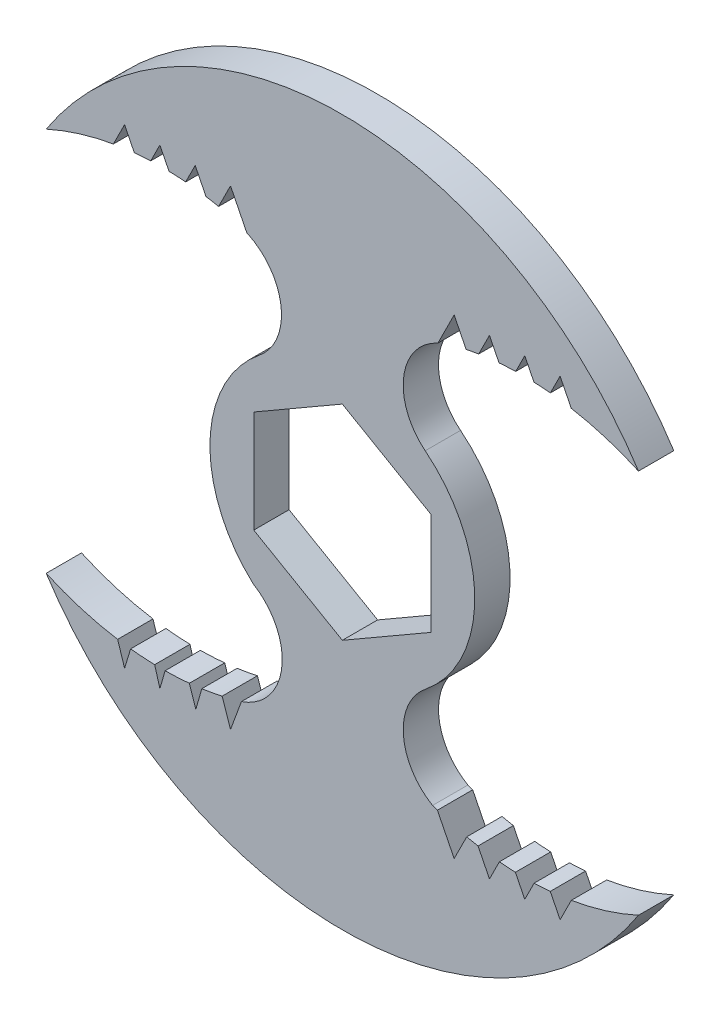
ISO-10303-21;
HEADER;
FILE_DESCRIPTION(('STEP AP214'),'2;1');
FILE_NAME('part.step','',(''),(''),'','','');
FILE_SCHEMA(('AUTOMOTIVE_DESIGN { 1 0 10303 214 1 1 1 1 }'));
ENDSEC;
DATA;
#1=APPLICATION_CONTEXT('core data for automotive mechanical design processes');
#2=APPLICATION_PROTOCOL_DEFINITION('international standard','automotive_design',2000,#1);
#3=PRODUCT_CONTEXT('',#1,'mechanical');
#4=PRODUCT('Part','Part','',(#3));
#5=PRODUCT_RELATED_PRODUCT_CATEGORY('part','',(#4));
#6=PRODUCT_DEFINITION_FORMATION('','',#4);
#7=PRODUCT_DEFINITION_CONTEXT('part definition',#1,'design');
#8=PRODUCT_DEFINITION('design','',#6,#7);
#9=PRODUCT_DEFINITION_SHAPE('','',#8);
#10=(LENGTH_UNIT() NAMED_UNIT(*) SI_UNIT(.MILLI.,.METRE.));
#11=(NAMED_UNIT(*) PLANE_ANGLE_UNIT() SI_UNIT($,.RADIAN.));
#12=(NAMED_UNIT(*) SI_UNIT($,.STERADIAN.) SOLID_ANGLE_UNIT());
#13=UNCERTAINTY_MEASURE_WITH_UNIT(LENGTH_MEASURE(1.E-05),#10,'distance_accuracy_value','');
#14=(GEOMETRIC_REPRESENTATION_CONTEXT(3) GLOBAL_UNCERTAINTY_ASSIGNED_CONTEXT((#13)) GLOBAL_UNIT_ASSIGNED_CONTEXT((#10,
#11,#12)) REPRESENTATION_CONTEXT('',''));
#15=CARTESIAN_POINT('',(0.,0.,0.));
#16=DIRECTION('',(0.,0.,1.));
#17=DIRECTION('',(1.,0.,0.));
#18=AXIS2_PLACEMENT_3D('',#15,#16,#17);
#19=CARTESIAN_POINT('',(-45.2851912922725,-43.523660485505,6.));
#20=DIRECTION('',(-0.5,0.866025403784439,0.));
#21=DIRECTION('',(-0.866025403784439,-0.5,0.));
#22=AXIS2_PLACEMENT_3D('',#19,#20,#21);
#23=PLANE('',#22);
#24=DIRECTION('',(0.866025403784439,0.5,0.));
#25=VECTOR('',#24,1.);
#26=CARTESIAN_POINT('',(-45.2851912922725,-43.523660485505,0.));
#27=LINE('',#26,#25);
#28=CARTESIAN_POINT('',(0.,-17.3782431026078,0.));
#29=VERTEX_POINT('',#28);
#30=CARTESIAN_POINT('',(15.05,-8.68912155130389,0.));
#31=VERTEX_POINT('',#30);
#32=EDGE_CURVE('E622',#29,#31,#27,.T.);
#33=ORIENTED_EDGE('',*,*,#32,.F.);
#34=DIRECTION('',(0.,0.,-1.));
#35=VECTOR('',#34,1.);
#36=CARTESIAN_POINT('',(0.,-17.3782431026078,6.));
#37=LINE('',#36,#35);
#38=CARTESIAN_POINT('',(0.,-17.3782431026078,6.));
#39=VERTEX_POINT('',#38);
#40=EDGE_CURVE('E11',#39,#29,#37,.T.);
#41=ORIENTED_EDGE('',*,*,#40,.F.);
#42=DIRECTION('',(0.866025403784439,0.5,0.));
#43=VECTOR('',#42,1.);
#44=CARTESIAN_POINT('',(-45.2851912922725,-43.523660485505,6.));
#45=LINE('',#44,#43);
#46=CARTESIAN_POINT('',(15.05,-8.68912155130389,6.00000000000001));
#47=VERTEX_POINT('',#46);
#48=EDGE_CURVE('E787',#39,#47,#45,.T.);
#49=ORIENTED_EDGE('',*,*,#48,.T.);
#50=DIRECTION('',(0.,0.,-1.));
#51=VECTOR('',#50,1.);
#52=CARTESIAN_POINT('',(15.05,-8.68912155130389,6.00000000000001));
#53=LINE('',#52,#51);
#54=EDGE_CURVE('E49',#47,#31,#53,.T.);
#55=ORIENTED_EDGE('',*,*,#54,.T.);
#56=EDGE_LOOP('',(#33,#41,#49,#55));
#57=FACE_BOUND('',#56,.T.);
#58=ADVANCED_FACE('F32',(#57),#23,.T.);
#59=CARTESIAN_POINT('',(45.2851912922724,-43.5236604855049,6.00000000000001));
#60=DIRECTION('',(0.500000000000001,0.866025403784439,0.));
#61=DIRECTION('',(-0.866025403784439,0.500000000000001,0.));
#62=AXIS2_PLACEMENT_3D('',#59,#60,#61);
#63=PLANE('',#62);
#64=DIRECTION('',(0.866025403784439,-0.500000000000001,0.));
#65=VECTOR('',#64,1.);
#66=CARTESIAN_POINT('',(45.2851912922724,-43.5236604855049,0.));
#67=LINE('',#66,#65);
#68=CARTESIAN_POINT('',(-15.05,-8.68912155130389,0.));
#69=VERTEX_POINT('',#68);
#70=EDGE_CURVE('E625',#69,#29,#67,.T.);
#71=ORIENTED_EDGE('',*,*,#70,.F.);
#72=DIRECTION('',(0.,0.,-1.));
#73=VECTOR('',#72,1.);
#74=CARTESIAN_POINT('',(-15.05,-8.68912155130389,6.));
#75=LINE('',#74,#73);
#76=CARTESIAN_POINT('',(-15.05,-8.68912155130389,6.));
#77=VERTEX_POINT('',#76);
#78=EDGE_CURVE('E41',#77,#69,#75,.T.);
#79=ORIENTED_EDGE('',*,*,#78,.F.);
#80=DIRECTION('',(0.866025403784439,-0.500000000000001,0.));
#81=VECTOR('',#80,1.);
#82=CARTESIAN_POINT('',(45.2851912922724,-43.5236604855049,6.00000000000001));
#83=LINE('',#82,#81);
#84=EDGE_CURVE('E789',#77,#39,#83,.T.);
#85=ORIENTED_EDGE('',*,*,#84,.T.);
#86=ORIENTED_EDGE('',*,*,#40,.T.);
#87=EDGE_LOOP('',(#71,#79,#85,#86));
#88=FACE_BOUND('',#87,.T.);
#89=ADVANCED_FACE('F1192',(#88),#63,.T.);
#90=CARTESIAN_POINT('',(-15.05,-121.959912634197,6.00000000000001));
#91=DIRECTION('',(1.,0.,0.));
#92=DIRECTION('',(0.,1.,0.));
#93=AXIS2_PLACEMENT_3D('',#90,#91,#92);
#94=PLANE('',#93);
#95=DIRECTION('',(0.,-1.,0.));
#96=VECTOR('',#95,1.);
#97=CARTESIAN_POINT('',(-15.05,-121.959912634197,0.));
#98=LINE('',#97,#96);
#99=CARTESIAN_POINT('',(-15.05,8.68912155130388,0.));
#100=VERTEX_POINT('',#99);
#101=EDGE_CURVE('E628',#100,#69,#98,.T.);
#102=ORIENTED_EDGE('',*,*,#101,.F.);
#103=DIRECTION('',(0.,0.,-1.));
#104=VECTOR('',#103,1.);
#105=CARTESIAN_POINT('',(-15.05,8.68912155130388,6.));
#106=LINE('',#105,#104);
#107=CARTESIAN_POINT('',(-15.05,8.68912155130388,6.));
#108=VERTEX_POINT('',#107);
#109=EDGE_CURVE('E806',#108,#100,#106,.T.);
#110=ORIENTED_EDGE('',*,*,#109,.F.);
#111=DIRECTION('',(0.,-1.,0.));
#112=VECTOR('',#111,1.);
#113=CARTESIAN_POINT('',(-15.05,-121.959912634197,6.00000000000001));
#114=LINE('',#113,#112);
#115=EDGE_CURVE('E792',#108,#77,#114,.T.);
#116=ORIENTED_EDGE('',*,*,#115,.T.);
#117=ORIENTED_EDGE('',*,*,#78,.T.);
#118=EDGE_LOOP('',(#102,#110,#116,#117));
#119=FACE_BOUND('',#118,.T.);
#120=ADVANCED_FACE('F1198',(#119),#94,.T.);
#121=CARTESIAN_POINT('',(-60.3351912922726,-17.4562958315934,6.));
#122=DIRECTION('',(0.5,-0.866025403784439,0.));
#123=DIRECTION('',(0.86602540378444,0.5,0.));
#124=AXIS2_PLACEMENT_3D('',#121,#122,#123);
#125=PLANE('',#124);
#126=DIRECTION('',(-0.86602540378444,-0.5,0.));
#127=VECTOR('',#126,1.);
#128=CARTESIAN_POINT('',(-60.3351912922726,-17.4562958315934,0.));
#129=LINE('',#128,#127);
#130=CARTESIAN_POINT('',(0.,17.3782431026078,0.));
#131=VERTEX_POINT('',#130);
#132=EDGE_CURVE('E631',#131,#100,#129,.T.);
#133=ORIENTED_EDGE('',*,*,#132,.F.);
#134=DIRECTION('',(0.,0.,-1.));
#135=VECTOR('',#134,1.);
#136=CARTESIAN_POINT('',(0.,17.3782431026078,6.00000000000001));
#137=LINE('',#136,#135);
#138=CARTESIAN_POINT('',(0.,17.3782431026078,6.00000000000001));
#139=VERTEX_POINT('',#138);
#140=EDGE_CURVE('E804',#139,#131,#137,.T.);
#141=ORIENTED_EDGE('',*,*,#140,.F.);
#142=DIRECTION('',(-0.86602540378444,-0.5,0.));
#143=VECTOR('',#142,1.);
#144=CARTESIAN_POINT('',(-60.3351912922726,-17.4562958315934,6.));
#145=LINE('',#144,#143);
#146=EDGE_CURVE('E795',#139,#108,#145,.T.);
#147=ORIENTED_EDGE('',*,*,#146,.T.);
#148=ORIENTED_EDGE('',*,*,#109,.T.);
#149=EDGE_LOOP('',(#133,#141,#147,#148));
#150=FACE_BOUND('',#149,.T.);
#151=ADVANCED_FACE('F1687',(#150),#125,.T.);
#152=CARTESIAN_POINT('',(60.3351912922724,-17.4562958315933,6.));
#153=DIRECTION('',(-0.500000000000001,-0.866025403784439,0.));
#154=DIRECTION('',(0.86602540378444,-0.500000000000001,0.));
#155=AXIS2_PLACEMENT_3D('',#152,#153,#154);
#156=PLANE('',#155);
#157=DIRECTION('',(-0.86602540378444,0.500000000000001,0.));
#158=VECTOR('',#157,1.);
#159=CARTESIAN_POINT('',(60.3351912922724,-17.4562958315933,0.));
#160=LINE('',#159,#158);
#161=CARTESIAN_POINT('',(15.05,8.68912155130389,0.));
#162=VERTEX_POINT('',#161);
#163=EDGE_CURVE('E634',#162,#131,#160,.T.);
#164=ORIENTED_EDGE('',*,*,#163,.F.);
#165=DIRECTION('',(0.,0.,-1.));
#166=VECTOR('',#165,1.);
#167=CARTESIAN_POINT('',(15.05,8.68912155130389,6.00000000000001));
#168=LINE('',#167,#166);
#169=CARTESIAN_POINT('',(15.05,8.68912155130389,6.00000000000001));
#170=VERTEX_POINT('',#169);
#171=EDGE_CURVE('E57',#170,#162,#168,.T.);
#172=ORIENTED_EDGE('',*,*,#171,.F.);
#173=DIRECTION('',(-0.86602540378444,0.500000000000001,0.));
#174=VECTOR('',#173,1.);
#175=CARTESIAN_POINT('',(60.3351912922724,-17.4562958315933,6.));
#176=LINE('',#175,#174);
#177=EDGE_CURVE('E798',#170,#139,#176,.T.);
#178=ORIENTED_EDGE('',*,*,#177,.T.);
#179=ORIENTED_EDGE('',*,*,#140,.T.);
#180=EDGE_LOOP('',(#164,#172,#178,#179));
#181=FACE_BOUND('',#180,.T.);
#182=ADVANCED_FACE('F1680',(#181),#156,.T.);
#183=CARTESIAN_POINT('',(-30.6462617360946,10.8192717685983,6.));
#184=DIRECTION('',(0.,0.,-1.));
#185=DIRECTION('',(-1.,0.,0.));
#186=AXIS2_PLACEMENT_3D('',#183,#184,#185);
#187=CYLINDRICAL_SURFACE('',#186,47.74);
#188=CARTESIAN_POINT('',(-30.6462617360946,10.8192717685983,0.));
#189=DIRECTION('',(0.,0.,1.));
#190=DIRECTION('',(1.,0.,0.));
#191=AXIS2_PLACEMENT_3D('',#188,#189,#190);
#192=CIRCLE('',#191,47.74);
#193=CARTESIAN_POINT('',(-35.972186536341,-36.6227151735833,0.));
#194=VERTEX_POINT('',#193);
#195=CARTESIAN_POINT('',(-31.8868681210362,-36.904605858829,0.));
#196=VERTEX_POINT('',#195);
#197=EDGE_CURVE('E454',#194,#196,#192,.T.);
#198=ORIENTED_EDGE('',*,*,#197,.F.);
#199=DIRECTION('',(0.,0.,-1.));
#200=VECTOR('',#199,1.);
#201=CARTESIAN_POINT('',(-35.972186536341,-36.6227151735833,6.00000000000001));
#202=LINE('',#201,#200);
#203=CARTESIAN_POINT('',(-35.972186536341,-36.6227151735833,6.00000000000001));
#204=VERTEX_POINT('',#203);
#205=EDGE_CURVE('E36',#204,#194,#202,.T.);
#206=ORIENTED_EDGE('',*,*,#205,.F.);
#207=CARTESIAN_POINT('',(-30.6462617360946,10.8192717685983,6.));
#208=DIRECTION('',(0.,0.,1.));
#209=DIRECTION('',(1.,0.,0.));
#210=AXIS2_PLACEMENT_3D('',#207,#208,#209);
#211=CIRCLE('',#210,47.74);
#212=CARTESIAN_POINT('',(-31.8868681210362,-36.904605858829,6.00000000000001));
#213=VERTEX_POINT('',#212);
#214=EDGE_CURVE('E640',#204,#213,#211,.T.);
#215=ORIENTED_EDGE('',*,*,#214,.T.);
#216=DIRECTION('',(0.,0.,-1.));
#217=VECTOR('',#216,1.);
#218=CARTESIAN_POINT('',(-31.8868681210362,-36.904605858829,6.00000000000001));
#219=LINE('',#218,#217);
#220=EDGE_CURVE('E456',#213,#196,#219,.T.);
#221=ORIENTED_EDGE('',*,*,#220,.T.);
#222=EDGE_LOOP('',(#198,#206,#215,#221));
#223=FACE_BOUND('',#222,.T.);
#224=ADVANCED_FACE('F34',(#223),#187,.F.);
#225=CARTESIAN_POINT('',(-56.6922680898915,-104.706681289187,6.00000000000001));
#226=DIRECTION('',(-0.956678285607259,0.291147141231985,0.));
#227=DIRECTION('',(-0.291147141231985,-0.95667828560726,0.));
#228=AXIS2_PLACEMENT_3D('',#225,#226,#227);
#229=PLANE('',#228);
#230=DIRECTION('',(0.291147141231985,0.956678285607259,0.));
#231=VECTOR('',#230,1.);
#232=CARTESIAN_POINT('',(-56.6922680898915,-104.706681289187,0.));
#233=LINE('',#232,#231);
#234=CARTESIAN_POINT('',(-37.,-40.,0.));
#235=VERTEX_POINT('',#234);
#236=EDGE_CURVE('E445',#235,#194,#233,.T.);
#237=ORIENTED_EDGE('',*,*,#236,.F.);
#238=DIRECTION('',(0.,0.,-1.));
#239=VECTOR('',#238,1.);
#240=CARTESIAN_POINT('',(-37.,-40.,6.00000000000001));
#241=LINE('',#240,#239);
#242=CARTESIAN_POINT('',(-37.,-40.,6.00000000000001));
#243=VERTEX_POINT('',#242);
#244=EDGE_CURVE('E452',#243,#235,#241,.T.);
#245=ORIENTED_EDGE('',*,*,#244,.F.);
#246=DIRECTION('',(0.291147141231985,0.956678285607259,0.));
#247=VECTOR('',#246,1.);
#248=CARTESIAN_POINT('',(-56.6922680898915,-104.706681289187,6.00000000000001));
#249=LINE('',#248,#247);
#250=EDGE_CURVE('E448',#243,#204,#249,.T.);
#251=ORIENTED_EDGE('',*,*,#250,.T.);
#252=ORIENTED_EDGE('',*,*,#205,.T.);
#253=EDGE_LOOP('',(#237,#245,#251,#252));
#254=FACE_BOUND('',#253,.T.);
#255=ADVANCED_FACE('F443',(#254),#229,.T.);
#256=CARTESIAN_POINT('',(-9.74934909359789,-125.082483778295,6.));
#257=DIRECTION('',(0.95234530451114,0.305022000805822,0.));
#258=DIRECTION('',(-0.305022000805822,0.95234530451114,0.));
#259=AXIS2_PLACEMENT_3D('',#256,#257,#258);
#260=PLANE('',#259);
#261=DIRECTION('',(0.305022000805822,-0.95234530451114,0.));
#262=VECTOR('',#261,1.);
#263=CARTESIAN_POINT('',(-9.74934909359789,-125.082483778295,0.));
#264=LINE('',#263,#262);
#265=CARTESIAN_POINT('',(-38.1777189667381,-36.3229041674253,0.));
#266=VERTEX_POINT('',#265);
#267=EDGE_CURVE('E465',#266,#235,#264,.T.);
#268=ORIENTED_EDGE('',*,*,#267,.F.);
#269=DIRECTION('',(0.,0.,-1.));
#270=VECTOR('',#269,1.);
#271=CARTESIAN_POINT('',(-38.1777189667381,-36.3229041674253,6.00000000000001));
#272=LINE('',#271,#270);
#273=CARTESIAN_POINT('',(-38.1777189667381,-36.3229041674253,6.00000000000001));
#274=VERTEX_POINT('',#273);
#275=EDGE_CURVE('E933',#274,#266,#272,.T.);
#276=ORIENTED_EDGE('',*,*,#275,.F.);
#277=DIRECTION('',(0.305022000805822,-0.95234530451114,0.));
#278=VECTOR('',#277,1.);
#279=CARTESIAN_POINT('',(-9.74934909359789,-125.082483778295,6.));
#280=LINE('',#279,#278);
#281=EDGE_CURVE('E643',#274,#243,#280,.T.);
#282=ORIENTED_EDGE('',*,*,#281,.T.);
#283=ORIENTED_EDGE('',*,*,#244,.T.);
#284=EDGE_LOOP('',(#268,#276,#282,#283));
#285=FACE_BOUND('',#284,.T.);
#286=ADVANCED_FACE('F935',(#285),#260,.T.);
#287=CARTESIAN_POINT('',(-30.6462617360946,10.8192717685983,6.));
#288=DIRECTION('',(0.,0.,-1.));
#289=DIRECTION('',(-1.,0.,0.));
#290=AXIS2_PLACEMENT_3D('',#287,#288,#289);
#291=CYLINDRICAL_SURFACE('',#290,47.74);
#292=CARTESIAN_POINT('',(-30.6462617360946,10.8192717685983,0.));
#293=DIRECTION('',(0.,0.,1.));
#294=DIRECTION('',(1.,0.,0.));
#295=AXIS2_PLACEMENT_3D('',#292,#293,#294);
#296=CIRCLE('',#295,47.74);
#297=CARTESIAN_POINT('',(-50.3202340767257,-32.6783421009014,0.));
#298=VERTEX_POINT('',#297);
#299=EDGE_CURVE('E467',#298,#266,#296,.T.);
#300=ORIENTED_EDGE('',*,*,#299,.F.);
#301=DIRECTION('',(0.,0.,-1.));
#302=VECTOR('',#301,1.);
#303=CARTESIAN_POINT('',(-50.3202340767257,-32.6783421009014,6.));
#304=LINE('',#303,#302);
#305=CARTESIAN_POINT('',(-50.3202340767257,-32.6783421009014,6.));
#306=VERTEX_POINT('',#305);
#307=EDGE_CURVE('E931',#306,#298,#304,.T.);
#308=ORIENTED_EDGE('',*,*,#307,.F.);
#309=CARTESIAN_POINT('',(-30.6462617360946,10.8192717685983,6.));
#310=DIRECTION('',(0.,0.,1.));
#311=DIRECTION('',(1.,0.,0.));
#312=AXIS2_PLACEMENT_3D('',#309,#310,#311);
#313=CIRCLE('',#312,47.74);
#314=EDGE_CURVE('E646',#306,#274,#313,.T.);
#315=ORIENTED_EDGE('',*,*,#314,.T.);
#316=ORIENTED_EDGE('',*,*,#275,.T.);
#317=EDGE_LOOP('',(#300,#308,#315,#316));
#318=FACE_BOUND('',#317,.T.);
#319=ADVANCED_FACE('F1181',(#318),#291,.F.);
#320=CARTESIAN_POINT('',(0.,0.,6.));
#321=DIRECTION('',(0.,0.,-1.));
#322=DIRECTION('',(-1.,0.,0.));
#323=AXIS2_PLACEMENT_3D('',#320,#321,#322);
#324=CYLINDRICAL_SURFACE('',#323,60.);
#325=CARTESIAN_POINT('',(0.,0.,0.));
#326=DIRECTION('',(0.,0.,1.));
#327=DIRECTION('',(1.,0.,0.));
#328=AXIS2_PLACEMENT_3D('',#325,#326,#327);
#329=CIRCLE('',#328,60.);
#330=CARTESIAN_POINT('',(50.3202340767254,-32.6783421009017,0.));
#331=VERTEX_POINT('',#330);
#332=EDGE_CURVE('E471',#331,#298,#329,.F.);
#333=ORIENTED_EDGE('',*,*,#332,.F.);
#334=DIRECTION('',(0.,0.,-1.));
#335=VECTOR('',#334,1.);
#336=CARTESIAN_POINT('',(50.3202340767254,-32.6783421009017,6.00000000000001));
#337=LINE('',#336,#335);
#338=CARTESIAN_POINT('',(50.3202340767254,-32.6783421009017,6.00000000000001));
#339=VERTEX_POINT('',#338);
#340=EDGE_CURVE('E929',#339,#331,#337,.T.);
#341=ORIENTED_EDGE('',*,*,#340,.F.);
#342=CARTESIAN_POINT('',(0.,0.,6.));
#343=DIRECTION('',(0.,0.,1.));
#344=DIRECTION('',(1.,0.,0.));
#345=AXIS2_PLACEMENT_3D('',#342,#343,#344);
#346=CIRCLE('',#345,60.);
#347=EDGE_CURVE('E649',#339,#306,#346,.F.);
#348=ORIENTED_EDGE('',*,*,#347,.T.);
#349=ORIENTED_EDGE('',*,*,#307,.T.);
#350=EDGE_LOOP('',(#333,#341,#348,#349));
#351=FACE_BOUND('',#350,.T.);
#352=ADVANCED_FACE('F1178',(#351),#324,.T.);
#353=CARTESIAN_POINT('',(31.2132969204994,9.05428602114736,6.));
#354=DIRECTION('',(0.,0.,-1.));
#355=DIRECTION('',(-1.,0.,0.));
#356=AXIS2_PLACEMENT_3D('',#353,#354,#355);
#357=CYLINDRICAL_SURFACE('',#356,45.8986633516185);
#358=CARTESIAN_POINT('',(31.2132969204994,9.05428602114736,0.));
#359=DIRECTION('',(0.,0.,1.));
#360=DIRECTION('',(1.,0.,0.));
#361=AXIS2_PLACEMENT_3D('',#358,#359,#360);
#362=CIRCLE('',#361,45.8986633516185);
#363=CARTESIAN_POINT('',(38.9021041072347,-36.1957917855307,0.));
#364=VERTEX_POINT('',#363);
#365=EDGE_CURVE('E474',#364,#331,#362,.T.);
#366=ORIENTED_EDGE('',*,*,#365,.F.);
#367=DIRECTION('',(0.,0.,-1.));
#368=VECTOR('',#367,1.);
#369=CARTESIAN_POINT('',(38.9021041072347,-36.1957917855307,6.));
#370=LINE('',#369,#368);
#371=CARTESIAN_POINT('',(38.9021041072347,-36.1957917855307,6.));
#372=VERTEX_POINT('',#371);
#373=EDGE_CURVE('E927',#372,#364,#370,.T.);
#374=ORIENTED_EDGE('',*,*,#373,.F.);
#375=CARTESIAN_POINT('',(31.2132969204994,9.05428602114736,6.));
#376=DIRECTION('',(0.,0.,1.));
#377=DIRECTION('',(1.,0.,0.));
#378=AXIS2_PLACEMENT_3D('',#375,#376,#377);
#379=CIRCLE('',#378,45.8986633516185);
#380=EDGE_CURVE('E652',#372,#339,#379,.T.);
#381=ORIENTED_EDGE('',*,*,#380,.T.);
#382=ORIENTED_EDGE('',*,*,#340,.T.);
#383=EDGE_LOOP('',(#366,#374,#381,#382));
#384=FACE_BOUND('',#383,.T.);
#385=ADVANCED_FACE('F1174',(#384),#357,.F.);
#386=CARTESIAN_POINT('',(-3.18396505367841,-120.367930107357,6.00000000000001));
#387=DIRECTION('',(0.894427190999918,-0.447213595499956,0.));
#388=DIRECTION('',(0.447213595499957,0.894427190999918,0.));
#389=AXIS2_PLACEMENT_3D('',#386,#387,#388);
#390=PLANE('',#389);
#391=DIRECTION('',(-0.447213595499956,-0.894427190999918,0.));
#392=VECTOR('',#391,1.);
#393=CARTESIAN_POINT('',(-3.18396505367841,-120.367930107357,0.));
#394=LINE('',#393,#392);
#395=CARTESIAN_POINT('',(37.,-40.,0.));
#396=VERTEX_POINT('',#395);
#397=EDGE_CURVE('E477',#364,#396,#394,.T.);
#398=ORIENTED_EDGE('',*,*,#397,.T.);
#399=DIRECTION('',(0.,0.,-1.));
#400=VECTOR('',#399,1.);
#401=CARTESIAN_POINT('',(37.,-40.,6.));
#402=LINE('',#401,#400);
#403=CARTESIAN_POINT('',(37.,-40.,6.));
#404=VERTEX_POINT('',#403);
#405=EDGE_CURVE('E924',#404,#396,#402,.T.);
#406=ORIENTED_EDGE('',*,*,#405,.F.);
#407=DIRECTION('',(-0.447213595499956,-0.894427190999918,0.));
#408=VECTOR('',#407,1.);
#409=CARTESIAN_POINT('',(-3.18396505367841,-120.367930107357,6.00000000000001));
#410=LINE('',#409,#408);
#411=EDGE_CURVE('E655',#372,#404,#410,.T.);
#412=ORIENTED_EDGE('',*,*,#411,.F.);
#413=ORIENTED_EDGE('',*,*,#373,.T.);
#414=EDGE_LOOP('',(#398,#406,#412,#413));
#415=FACE_BOUND('',#414,.T.);
#416=ADVANCED_FACE('F1171',(#415),#390,.F.);
#417=CARTESIAN_POINT('',(62.3839650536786,-90.767930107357,6.00000000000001));
#418=DIRECTION('',(-0.894427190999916,-0.44721359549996,0.));
#419=DIRECTION('',(0.44721359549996,-0.894427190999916,0.));
#420=AXIS2_PLACEMENT_3D('',#417,#418,#419);
#421=PLANE('',#420);
#422=DIRECTION('',(-0.44721359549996,0.894427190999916,0.));
#423=VECTOR('',#422,1.);
#424=CARTESIAN_POINT('',(62.3839650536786,-90.767930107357,0.));
#425=LINE('',#424,#423);
#426=CARTESIAN_POINT('',(35.3297075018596,-36.6594150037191,0.));
#427=VERTEX_POINT('',#426);
#428=EDGE_CURVE('E479',#396,#427,#425,.T.);
#429=ORIENTED_EDGE('',*,*,#428,.T.);
#430=DIRECTION('',(0.,0.,-1.));
#431=VECTOR('',#430,1.);
#432=CARTESIAN_POINT('',(35.3297075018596,-36.6594150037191,6.));
#433=LINE('',#432,#431);
#434=CARTESIAN_POINT('',(35.3297075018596,-36.6594150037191,6.));
#435=VERTEX_POINT('',#434);
#436=EDGE_CURVE('E922',#435,#427,#433,.T.);
#437=ORIENTED_EDGE('',*,*,#436,.F.);
#438=DIRECTION('',(-0.44721359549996,0.894427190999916,0.));
#439=VECTOR('',#438,1.);
#440=CARTESIAN_POINT('',(62.3839650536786,-90.767930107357,6.00000000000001));
#441=LINE('',#440,#439);
#442=EDGE_CURVE('E657',#404,#435,#441,.T.);
#443=ORIENTED_EDGE('',*,*,#442,.F.);
#444=ORIENTED_EDGE('',*,*,#405,.T.);
#445=EDGE_LOOP('',(#429,#437,#443,#444));
#446=FACE_BOUND('',#445,.T.);
#447=ADVANCED_FACE('F1166',(#446),#421,.F.);
#448=CARTESIAN_POINT('',(31.2132969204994,9.05428602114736,6.));
#449=DIRECTION('',(0.,0.,-1.));
#450=DIRECTION('',(-1.,0.,0.));
#451=AXIS2_PLACEMENT_3D('',#448,#449,#450);
#452=CYLINDRICAL_SURFACE('',#451,45.8986633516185);
#453=CARTESIAN_POINT('',(31.2132969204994,9.05428602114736,0.));
#454=DIRECTION('',(0.,0.,1.));
#455=DIRECTION('',(1.,0.,0.));
#456=AXIS2_PLACEMENT_3D('',#453,#454,#455);
#457=CIRCLE('',#456,45.8986633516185);
#458=CARTESIAN_POINT('',(32.5881086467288,-36.8237827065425,0.));
#459=VERTEX_POINT('',#458);
#460=EDGE_CURVE('E482',#459,#427,#457,.T.);
#461=ORIENTED_EDGE('',*,*,#460,.F.);
#462=DIRECTION('',(0.,0.,-1.));
#463=VECTOR('',#462,1.);
#464=CARTESIAN_POINT('',(32.5881086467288,-36.8237827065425,6.));
#465=LINE('',#464,#463);
#466=CARTESIAN_POINT('',(32.5881086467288,-36.8237827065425,6.));
#467=VERTEX_POINT('',#466);
#468=EDGE_CURVE('E920',#467,#459,#465,.T.);
#469=ORIENTED_EDGE('',*,*,#468,.F.);
#470=CARTESIAN_POINT('',(31.2132969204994,9.05428602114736,6.));
#471=DIRECTION('',(0.,0.,1.));
#472=DIRECTION('',(1.,0.,0.));
#473=AXIS2_PLACEMENT_3D('',#470,#471,#472);
#474=CIRCLE('',#473,45.8986633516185);
#475=EDGE_CURVE('E659',#467,#435,#474,.T.);
#476=ORIENTED_EDGE('',*,*,#475,.T.);
#477=ORIENTED_EDGE('',*,*,#436,.T.);
#478=EDGE_LOOP('',(#461,#469,#476,#477));
#479=FACE_BOUND('',#478,.T.);
#480=ADVANCED_FACE('F1160',(#479),#452,.F.);
#481=CARTESIAN_POINT('',(-7.98396505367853,-117.967930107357,6.00000000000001));
#482=DIRECTION('',(0.894427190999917,-0.447213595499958,0.));
#483=DIRECTION('',(0.447213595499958,0.894427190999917,0.));
#484=AXIS2_PLACEMENT_3D('',#481,#482,#483);
#485=PLANE('',#484);
#486=DIRECTION('',(-0.447213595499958,-0.894427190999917,0.));
#487=VECTOR('',#486,1.);
#488=CARTESIAN_POINT('',(-7.98396505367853,-117.967930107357,0.));
#489=LINE('',#488,#487);
#490=CARTESIAN_POINT('',(31.,-40.,0.));
#491=VERTEX_POINT('',#490);
#492=EDGE_CURVE('E485',#459,#491,#489,.T.);
#493=ORIENTED_EDGE('',*,*,#492,.T.);
#494=DIRECTION('',(0.,0.,-1.));
#495=VECTOR('',#494,1.);
#496=CARTESIAN_POINT('',(31.,-40.,6.));
#497=LINE('',#496,#495);
#498=CARTESIAN_POINT('',(31.,-40.,6.));
#499=VERTEX_POINT('',#498);
#500=EDGE_CURVE('E917',#499,#491,#497,.T.);
#501=ORIENTED_EDGE('',*,*,#500,.F.);
#502=DIRECTION('',(-0.447213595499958,-0.894427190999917,0.));
#503=VECTOR('',#502,1.);
#504=CARTESIAN_POINT('',(-7.98396505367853,-117.967930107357,6.00000000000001));
#505=LINE('',#504,#503);
#506=EDGE_CURVE('E662',#467,#499,#505,.T.);
#507=ORIENTED_EDGE('',*,*,#506,.F.);
#508=ORIENTED_EDGE('',*,*,#468,.T.);
#509=EDGE_LOOP('',(#493,#501,#507,#508));
#510=FACE_BOUND('',#509,.T.);
#511=ADVANCED_FACE('F1157',(#510),#485,.F.);
#512=CARTESIAN_POINT('',(57.5839650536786,-93.1679301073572,6.00000000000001));
#513=DIRECTION('',(-0.894427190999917,-0.447213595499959,0.));
#514=DIRECTION('',(0.447213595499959,-0.894427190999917,0.));
#515=AXIS2_PLACEMENT_3D('',#512,#513,#514);
#516=PLANE('',#515);
#517=DIRECTION('',(-0.447213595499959,0.894427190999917,0.));
#518=VECTOR('',#517,1.);
#519=CARTESIAN_POINT('',(57.5839650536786,-93.1679301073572,0.));
#520=LINE('',#519,#518);
#521=CARTESIAN_POINT('',(29.4043584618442,-36.8087169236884,0.));
#522=VERTEX_POINT('',#521);
#523=EDGE_CURVE('E487',#491,#522,#520,.T.);
#524=ORIENTED_EDGE('',*,*,#523,.T.);
#525=DIRECTION('',(0.,0.,-1.));
#526=VECTOR('',#525,1.);
#527=CARTESIAN_POINT('',(29.4043584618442,-36.8087169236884,6.00000000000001));
#528=LINE('',#527,#526);
#529=CARTESIAN_POINT('',(29.4043584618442,-36.8087169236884,6.00000000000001));
#530=VERTEX_POINT('',#529);
#531=EDGE_CURVE('E915',#530,#522,#528,.T.);
#532=ORIENTED_EDGE('',*,*,#531,.F.);
#533=DIRECTION('',(-0.447213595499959,0.894427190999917,0.));
#534=VECTOR('',#533,1.);
#535=CARTESIAN_POINT('',(57.5839650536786,-93.1679301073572,6.00000000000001));
#536=LINE('',#535,#534);
#537=EDGE_CURVE('E664',#499,#530,#536,.T.);
#538=ORIENTED_EDGE('',*,*,#537,.F.);
#539=ORIENTED_EDGE('',*,*,#500,.T.);
#540=EDGE_LOOP('',(#524,#532,#538,#539));
#541=FACE_BOUND('',#540,.T.);
#542=ADVANCED_FACE('F1152',(#541),#516,.F.);
#543=CARTESIAN_POINT('',(31.2132969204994,9.05428602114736,6.));
#544=DIRECTION('',(0.,0.,-1.));
#545=DIRECTION('',(-1.,0.,0.));
#546=AXIS2_PLACEMENT_3D('',#543,#544,#545);
#547=CYLINDRICAL_SURFACE('',#546,45.8986633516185);
#548=CARTESIAN_POINT('',(31.2132969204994,9.05428602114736,0.));
#549=DIRECTION('',(0.,0.,1.));
#550=DIRECTION('',(1.,0.,0.));
#551=AXIS2_PLACEMENT_3D('',#548,#549,#550);
#552=CIRCLE('',#551,45.8986633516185);
#553=CARTESIAN_POINT('',(26.6895479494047,-36.6209041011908,0.));
#554=VERTEX_POINT('',#553);
#555=EDGE_CURVE('E490',#554,#522,#552,.T.);
#556=ORIENTED_EDGE('',*,*,#555,.F.);
#557=DIRECTION('',(0.,0.,-1.));
#558=VECTOR('',#557,1.);
#559=CARTESIAN_POINT('',(26.6895479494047,-36.6209041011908,6.00000000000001));
#560=LINE('',#559,#558);
#561=CARTESIAN_POINT('',(26.6895479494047,-36.6209041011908,6.00000000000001));
#562=VERTEX_POINT('',#561);
#563=EDGE_CURVE('E913',#562,#554,#560,.T.);
#564=ORIENTED_EDGE('',*,*,#563,.F.);
#565=CARTESIAN_POINT('',(31.2132969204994,9.05428602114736,6.));
#566=DIRECTION('',(0.,0.,1.));
#567=DIRECTION('',(1.,0.,0.));
#568=AXIS2_PLACEMENT_3D('',#565,#566,#567);
#569=CIRCLE('',#568,45.8986633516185);
#570=EDGE_CURVE('E666',#562,#530,#569,.T.);
#571=ORIENTED_EDGE('',*,*,#570,.T.);
#572=ORIENTED_EDGE('',*,*,#531,.T.);
#573=EDGE_LOOP('',(#556,#564,#571,#572));
#574=FACE_BOUND('',#573,.T.);
#575=ADVANCED_FACE('F1146',(#574),#547,.F.);
#576=CARTESIAN_POINT('',(-12.7839650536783,-115.567930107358,5.99999999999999));
#577=DIRECTION('',(0.894427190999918,-0.447213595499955,0.));
#578=DIRECTION('',(0.447213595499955,0.894427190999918,0.));
#579=AXIS2_PLACEMENT_3D('',#576,#577,#578);
#580=PLANE('',#579);
#581=DIRECTION('',(-0.447213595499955,-0.894427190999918,0.));
#582=VECTOR('',#581,1.);
#583=CARTESIAN_POINT('',(-12.7839650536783,-115.567930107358,0.));
#584=LINE('',#583,#582);
#585=CARTESIAN_POINT('',(25.,-40.0000000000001,0.));
#586=VERTEX_POINT('',#585);
#587=EDGE_CURVE('E493',#554,#586,#584,.T.);
#588=ORIENTED_EDGE('',*,*,#587,.T.);
#589=DIRECTION('',(0.,0.,-1.));
#590=VECTOR('',#589,1.);
#591=CARTESIAN_POINT('',(25.,-40.0000000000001,6.00000000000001));
#592=LINE('',#591,#590);
#593=CARTESIAN_POINT('',(25.,-40.0000000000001,6.00000000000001));
#594=VERTEX_POINT('',#593);
#595=EDGE_CURVE('E910',#594,#586,#592,.T.);
#596=ORIENTED_EDGE('',*,*,#595,.F.);
#597=DIRECTION('',(-0.447213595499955,-0.894427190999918,0.));
#598=VECTOR('',#597,1.);
#599=CARTESIAN_POINT('',(-12.7839650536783,-115.567930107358,5.99999999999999));
#600=LINE('',#599,#598);
#601=EDGE_CURVE('E669',#562,#594,#600,.T.);
#602=ORIENTED_EDGE('',*,*,#601,.F.);
#603=ORIENTED_EDGE('',*,*,#563,.T.);
#604=EDGE_LOOP('',(#588,#596,#602,#603));
#605=FACE_BOUND('',#604,.T.);
#606=ADVANCED_FACE('F1143',(#605),#580,.F.);
#607=CARTESIAN_POINT('',(52.7839650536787,-95.5679301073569,6.00000000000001));
#608=DIRECTION('',(-0.894427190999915,-0.447213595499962,0.));
#609=DIRECTION('',(0.447213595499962,-0.894427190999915,0.));
#610=AXIS2_PLACEMENT_3D('',#607,#608,#609);
#611=PLANE('',#610);
#612=DIRECTION('',(-0.447213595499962,0.894427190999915,0.));
#613=VECTOR('',#612,1.);
#614=CARTESIAN_POINT('',(52.7839650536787,-95.5679301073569,0.));
#615=LINE('',#614,#613);
#616=CARTESIAN_POINT('',(23.0569273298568,-36.1138546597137,0.));
#617=VERTEX_POINT('',#616);
#618=EDGE_CURVE('E495',#586,#617,#615,.T.);
#619=ORIENTED_EDGE('',*,*,#618,.T.);
#620=DIRECTION('',(0.,0.,-1.));
#621=VECTOR('',#620,1.);
#622=CARTESIAN_POINT('',(23.0569273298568,-36.1138546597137,6.00000000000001));
#623=LINE('',#622,#621);
#624=CARTESIAN_POINT('',(23.0569273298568,-36.1138546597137,6.00000000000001));
#625=VERTEX_POINT('',#624);
#626=EDGE_CURVE('E908',#625,#617,#623,.T.);
#627=ORIENTED_EDGE('',*,*,#626,.F.);
#628=DIRECTION('',(-0.447213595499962,0.894427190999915,0.));
#629=VECTOR('',#628,1.);
#630=CARTESIAN_POINT('',(52.7839650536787,-95.5679301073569,6.00000000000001));
#631=LINE('',#630,#629);
#632=EDGE_CURVE('E671',#594,#625,#631,.T.);
#633=ORIENTED_EDGE('',*,*,#632,.F.);
#634=ORIENTED_EDGE('',*,*,#595,.T.);
#635=EDGE_LOOP('',(#619,#627,#633,#634));
#636=FACE_BOUND('',#635,.T.);
#637=ADVANCED_FACE('F1138',(#636),#611,.F.);
#638=CARTESIAN_POINT('',(31.2132969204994,9.05428602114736,6.));
#639=DIRECTION('',(0.,0.,-1.));
#640=DIRECTION('',(-1.,0.,0.));
#641=AXIS2_PLACEMENT_3D('',#638,#639,#640);
#642=CYLINDRICAL_SURFACE('',#641,45.8986633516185);
#643=CARTESIAN_POINT('',(31.2132969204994,9.05428602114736,0.));
#644=DIRECTION('',(0.,0.,1.));
#645=DIRECTION('',(1.,0.,0.));
#646=AXIS2_PLACEMENT_3D('',#643,#644,#645);
#647=CIRCLE('',#646,45.8986633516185);
#648=CARTESIAN_POINT('',(21.1375945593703,-35.7248108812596,0.));
#649=VERTEX_POINT('',#648);
#650=EDGE_CURVE('E498',#649,#617,#647,.T.);
#651=ORIENTED_EDGE('',*,*,#650,.F.);
#652=DIRECTION('',(0.,0.,-1.));
#653=VECTOR('',#652,1.);
#654=CARTESIAN_POINT('',(21.1375945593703,-35.7248108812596,6.00000000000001));
#655=LINE('',#654,#653);
#656=CARTESIAN_POINT('',(21.1375945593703,-35.7248108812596,6.00000000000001));
#657=VERTEX_POINT('',#656);
#658=EDGE_CURVE('E906',#657,#649,#655,.T.);
#659=ORIENTED_EDGE('',*,*,#658,.F.);
#660=CARTESIAN_POINT('',(31.2132969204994,9.05428602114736,6.));
#661=DIRECTION('',(0.,0.,1.));
#662=DIRECTION('',(1.,0.,0.));
#663=AXIS2_PLACEMENT_3D('',#660,#661,#662);
#664=CIRCLE('',#663,45.8986633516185);
#665=EDGE_CURVE('E673',#657,#625,#664,.T.);
#666=ORIENTED_EDGE('',*,*,#665,.T.);
#667=ORIENTED_EDGE('',*,*,#626,.T.);
#668=EDGE_LOOP('',(#651,#659,#666,#667));
#669=FACE_BOUND('',#668,.T.);
#670=ADVANCED_FACE('F1132',(#669),#642,.F.);
#671=CARTESIAN_POINT('',(-17.5839650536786,-113.167930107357,6.));
#672=DIRECTION('',(0.894427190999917,-0.447213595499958,0.));
#673=DIRECTION('',(0.447213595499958,0.894427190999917,0.));
#674=AXIS2_PLACEMENT_3D('',#671,#672,#673);
#675=PLANE('',#674);
#676=DIRECTION('',(-0.447213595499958,-0.894427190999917,0.));
#677=VECTOR('',#676,1.);
#678=CARTESIAN_POINT('',(-17.5839650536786,-113.167930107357,0.));
#679=LINE('',#678,#677);
#680=CARTESIAN_POINT('',(19.,-40.0000000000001,0.));
#681=VERTEX_POINT('',#680);
#682=EDGE_CURVE('E501',#649,#681,#679,.T.);
#683=ORIENTED_EDGE('',*,*,#682,.T.);
#684=DIRECTION('',(0.,0.,-1.));
#685=VECTOR('',#684,1.);
#686=CARTESIAN_POINT('',(19.,-40.0000000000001,6.00000000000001));
#687=LINE('',#686,#685);
#688=CARTESIAN_POINT('',(19.,-40.0000000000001,6.00000000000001));
#689=VERTEX_POINT('',#688);
#690=EDGE_CURVE('E903',#689,#681,#687,.T.);
#691=ORIENTED_EDGE('',*,*,#690,.F.);
#692=DIRECTION('',(-0.447213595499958,-0.894427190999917,0.));
#693=VECTOR('',#692,1.);
#694=CARTESIAN_POINT('',(-17.5839650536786,-113.167930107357,6.));
#695=LINE('',#694,#693);
#696=EDGE_CURVE('E676',#657,#689,#695,.T.);
#697=ORIENTED_EDGE('',*,*,#696,.F.);
#698=ORIENTED_EDGE('',*,*,#658,.T.);
#699=EDGE_LOOP('',(#683,#691,#697,#698));
#700=FACE_BOUND('',#699,.T.);
#701=ADVANCED_FACE('F1129',(#700),#675,.F.);
#702=CARTESIAN_POINT('',(47.9839650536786,-97.9679301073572,6.00000000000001));
#703=DIRECTION('',(-0.894427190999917,-0.447213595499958,0.));
#704=DIRECTION('',(0.447213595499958,-0.894427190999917,0.));
#705=AXIS2_PLACEMENT_3D('',#702,#703,#704);
#706=PLANE('',#705);
#707=DIRECTION('',(-0.447213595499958,0.894427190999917,0.));
#708=VECTOR('',#707,1.);
#709=CARTESIAN_POINT('',(47.9839650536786,-97.9679301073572,0.));
#710=LINE('',#709,#708);
#711=CARTESIAN_POINT('',(16.1513277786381,-34.3026555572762,0.));
#712=VERTEX_POINT('',#711);
#713=EDGE_CURVE('E503',#681,#712,#710,.T.);
#714=ORIENTED_EDGE('',*,*,#713,.T.);
#715=DIRECTION('',(0.,0.,-1.));
#716=VECTOR('',#715,1.);
#717=CARTESIAN_POINT('',(16.1513277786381,-34.3026555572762,6.00000000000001));
#718=LINE('',#717,#716);
#719=CARTESIAN_POINT('',(16.1513277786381,-34.3026555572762,6.00000000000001));
#720=VERTEX_POINT('',#719);
#721=EDGE_CURVE('E901',#720,#712,#718,.T.);
#722=ORIENTED_EDGE('',*,*,#721,.F.);
#723=DIRECTION('',(-0.447213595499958,0.894427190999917,0.));
#724=VECTOR('',#723,1.);
#725=CARTESIAN_POINT('',(47.9839650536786,-97.9679301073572,6.00000000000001));
#726=LINE('',#725,#724);
#727=EDGE_CURVE('E678',#689,#720,#726,.T.);
#728=ORIENTED_EDGE('',*,*,#727,.F.);
#729=ORIENTED_EDGE('',*,*,#690,.T.);
#730=EDGE_LOOP('',(#714,#722,#728,#729));
#731=FACE_BOUND('',#730,.T.);
#732=ADVANCED_FACE('F1124',(#731),#706,.F.);
#733=CARTESIAN_POINT('',(31.2132969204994,9.05428602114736,6.));
#734=DIRECTION('',(0.,0.,-1.));
#735=DIRECTION('',(-1.,0.,0.));
#736=AXIS2_PLACEMENT_3D('',#733,#734,#735);
#737=CYLINDRICAL_SURFACE('',#736,45.8986633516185);
#738=CARTESIAN_POINT('',(31.2132969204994,9.05428602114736,0.));
#739=DIRECTION('',(0.,0.,1.));
#740=DIRECTION('',(1.,0.,0.));
#741=AXIS2_PLACEMENT_3D('',#738,#739,#740);
#742=CIRCLE('',#741,45.8986633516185);
#743=CARTESIAN_POINT('',(15.3351003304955,-34.0104346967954,0.));
#744=VERTEX_POINT('',#743);
#745=EDGE_CURVE('E506',#744,#712,#742,.T.);
#746=ORIENTED_EDGE('',*,*,#745,.F.);
#747=DIRECTION('',(0.,0.,-1.));
#748=VECTOR('',#747,1.);
#749=CARTESIAN_POINT('',(15.3351003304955,-34.0104346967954,6.));
#750=LINE('',#749,#748);
#751=CARTESIAN_POINT('',(15.3351003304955,-34.0104346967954,6.));
#752=VERTEX_POINT('',#751);
#753=EDGE_CURVE('E899',#752,#744,#750,.T.);
#754=ORIENTED_EDGE('',*,*,#753,.F.);
#755=CARTESIAN_POINT('',(31.2132969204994,9.05428602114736,6.));
#756=DIRECTION('',(0.,0.,1.));
#757=DIRECTION('',(1.,0.,0.));
#758=AXIS2_PLACEMENT_3D('',#755,#756,#757);
#759=CIRCLE('',#758,45.8986633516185);
#760=EDGE_CURVE('E680',#752,#720,#759,.T.);
#761=ORIENTED_EDGE('',*,*,#760,.T.);
#762=ORIENTED_EDGE('',*,*,#721,.T.);
#763=EDGE_LOOP('',(#746,#754,#761,#762));
#764=FACE_BOUND('',#763,.T.);
#765=ADVANCED_FACE('F1118',(#764),#737,.F.);
#766=CARTESIAN_POINT('',(20.35,-25.35,6.00000000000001));
#767=DIRECTION('',(0.,0.,-1.));
#768=DIRECTION('',(-1.,0.,0.));
#769=AXIS2_PLACEMENT_3D('',#766,#767,#768);
#770=CYLINDRICAL_SURFACE('',#769,10.0076144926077);
#771=CARTESIAN_POINT('',(20.35,-25.35,0.));
#772=DIRECTION('',(0.,0.,1.));
#773=DIRECTION('',(1.,0.,0.));
#774=AXIS2_PLACEMENT_3D('',#771,#772,#773);
#775=CIRCLE('',#774,10.0076144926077);
#776=CARTESIAN_POINT('',(14.085161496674,-17.5458891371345,0.));
#777=VERTEX_POINT('',#776);
#778=EDGE_CURVE('E509',#777,#744,#775,.T.);
#779=ORIENTED_EDGE('',*,*,#778,.F.);
#780=DIRECTION('',(0.,0.,-1.));
#781=VECTOR('',#780,1.);
#782=CARTESIAN_POINT('',(14.085161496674,-17.5458891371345,6.));
#783=LINE('',#782,#781);
#784=CARTESIAN_POINT('',(14.085161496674,-17.5458891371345,6.));
#785=VERTEX_POINT('',#784);
#786=EDGE_CURVE('E897',#785,#777,#783,.T.);
#787=ORIENTED_EDGE('',*,*,#786,.F.);
#788=CARTESIAN_POINT('',(20.35,-25.35,6.00000000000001));
#789=DIRECTION('',(0.,0.,1.));
#790=DIRECTION('',(1.,0.,0.));
#791=AXIS2_PLACEMENT_3D('',#788,#789,#790);
#792=CIRCLE('',#791,10.0076144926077);
#793=EDGE_CURVE('E683',#785,#752,#792,.T.);
#794=ORIENTED_EDGE('',*,*,#793,.T.);
#795=ORIENTED_EDGE('',*,*,#753,.T.);
#796=EDGE_LOOP('',(#779,#787,#794,#795));
#797=FACE_BOUND('',#796,.T.);
#798=ADVANCED_FACE('F1112',(#797),#770,.F.);
#799=CARTESIAN_POINT('',(0.,0.,6.));
#800=DIRECTION('',(0.,0.,-1.));
#801=DIRECTION('',(-1.,0.,0.));
#802=AXIS2_PLACEMENT_3D('',#799,#800,#801);
#803=CYLINDRICAL_SURFACE('',#802,22.5);
#804=CARTESIAN_POINT('',(0.,0.,0.));
#805=DIRECTION('',(0.,0.,1.));
#806=DIRECTION('',(1.,0.,0.));
#807=AXIS2_PLACEMENT_3D('',#804,#805,#806);
#808=CIRCLE('',#807,22.5);
#809=CARTESIAN_POINT('',(14.0800390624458,17.55,0.));
#810=VERTEX_POINT('',#809);
#811=EDGE_CURVE('E512',#777,#810,#808,.T.);
#812=ORIENTED_EDGE('',*,*,#811,.T.);
#813=DIRECTION('',(0.,0.,-1.));
#814=VECTOR('',#813,1.);
#815=CARTESIAN_POINT('',(14.0800390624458,17.55,6.00000000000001));
#816=LINE('',#815,#814);
#817=CARTESIAN_POINT('',(14.0800390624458,17.55,6.00000000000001));
#818=VERTEX_POINT('',#817);
#819=EDGE_CURVE('E895',#818,#810,#816,.T.);
#820=ORIENTED_EDGE('',*,*,#819,.F.);
#821=CARTESIAN_POINT('',(0.,0.,6.));
#822=DIRECTION('',(0.,0.,1.));
#823=DIRECTION('',(1.,0.,0.));
#824=AXIS2_PLACEMENT_3D('',#821,#822,#823);
#825=CIRCLE('',#824,22.5);
#826=EDGE_CURVE('E686',#785,#818,#825,.T.);
#827=ORIENTED_EDGE('',*,*,#826,.F.);
#828=ORIENTED_EDGE('',*,*,#786,.T.);
#829=EDGE_LOOP('',(#812,#820,#827,#828));
#830=FACE_BOUND('',#829,.T.);
#831=ADVANCED_FACE('F1182',(#830),#803,.T.);
#832=CARTESIAN_POINT('',(20.3378342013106,25.35,6.00000000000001));
#833=DIRECTION('',(0.,0.,-1.));
#834=DIRECTION('',(-1.,0.,0.));
#835=AXIS2_PLACEMENT_3D('',#832,#833,#834);
#836=CYLINDRICAL_SURFACE('',#835,10.);
#837=CARTESIAN_POINT('',(20.3378342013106,25.35,0.));
#838=DIRECTION('',(0.,0.,1.));
#839=DIRECTION('',(1.,0.,0.));
#840=AXIS2_PLACEMENT_3D('',#837,#838,#839);
#841=CIRCLE('',#840,10.);
#842=CARTESIAN_POINT('',(16.0122100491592,34.3660399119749,0.));
#843=VERTEX_POINT('',#842);
#844=EDGE_CURVE('E515',#843,#810,#841,.T.);
#845=ORIENTED_EDGE('',*,*,#844,.F.);
#846=DIRECTION('',(0.,0.,-1.));
#847=VECTOR('',#846,1.);
#848=CARTESIAN_POINT('',(16.0122100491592,34.3660399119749,6.00000000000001));
#849=LINE('',#848,#847);
#850=CARTESIAN_POINT('',(16.0122100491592,34.3660399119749,6.00000000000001));
#851=VERTEX_POINT('',#850);
#852=EDGE_CURVE('E893',#851,#843,#849,.T.);
#853=ORIENTED_EDGE('',*,*,#852,.F.);
#854=CARTESIAN_POINT('',(20.3378342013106,25.35,6.00000000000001));
#855=DIRECTION('',(0.,0.,1.));
#856=DIRECTION('',(1.,0.,0.));
#857=AXIS2_PLACEMENT_3D('',#854,#855,#856);
#858=CIRCLE('',#857,10.);
#859=EDGE_CURVE('E688',#851,#818,#858,.T.);
#860=ORIENTED_EDGE('',*,*,#859,.T.);
#861=ORIENTED_EDGE('',*,*,#819,.T.);
#862=EDGE_LOOP('',(#845,#853,#860,#861));
#863=FACE_BOUND('',#862,.T.);
#864=ADVANCED_FACE('F1106',(#863),#836,.F.);
#865=CARTESIAN_POINT('',(32.5,0.,6.));
#866=DIRECTION('',(0.,0.,-1.));
#867=DIRECTION('',(-1.,0.,0.));
#868=AXIS2_PLACEMENT_3D('',#865,#866,#867);
#869=CYLINDRICAL_SURFACE('',#868,38.1165569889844);
#870=CARTESIAN_POINT('',(32.5,0.,0.));
#871=DIRECTION('',(0.,0.,1.));
#872=DIRECTION('',(1.,0.,0.));
#873=AXIS2_PLACEMENT_3D('',#870,#871,#872);
#874=CIRCLE('',#873,38.1165569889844);
#875=CARTESIAN_POINT('',(16.2363363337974,34.4726726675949,0.));
#876=VERTEX_POINT('',#875);
#877=EDGE_CURVE('E518',#843,#876,#874,.F.);
#878=ORIENTED_EDGE('',*,*,#877,.T.);
#879=DIRECTION('',(0.,0.,-1.));
#880=VECTOR('',#879,1.);
#881=CARTESIAN_POINT('',(16.2363363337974,34.4726726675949,6.00000000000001));
#882=LINE('',#881,#880);
#883=CARTESIAN_POINT('',(16.2363363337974,34.4726726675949,6.00000000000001));
#884=VERTEX_POINT('',#883);
#885=EDGE_CURVE('E890',#884,#876,#882,.T.);
#886=ORIENTED_EDGE('',*,*,#885,.F.);
#887=CARTESIAN_POINT('',(32.5,0.,6.));
#888=DIRECTION('',(0.,0.,1.));
#889=DIRECTION('',(1.,0.,0.));
#890=AXIS2_PLACEMENT_3D('',#887,#888,#889);
#891=CIRCLE('',#890,38.1165569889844);
#892=EDGE_CURVE('E691',#851,#884,#891,.F.);
#893=ORIENTED_EDGE('',*,*,#892,.F.);
#894=ORIENTED_EDGE('',*,*,#852,.T.);
#895=EDGE_LOOP('',(#878,#886,#893,#894));
#896=FACE_BOUND('',#895,.T.);
#897=ADVANCED_FACE('F1103',(#896),#869,.F.);
#898=CARTESIAN_POINT('',(-49.5839650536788,-97.1679301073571,6.00000000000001));
#899=DIRECTION('',(-0.894427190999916,0.44721359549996,0.));
#900=DIRECTION('',(-0.44721359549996,-0.894427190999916,0.));
#901=AXIS2_PLACEMENT_3D('',#898,#899,#900);
#902=PLANE('',#901);
#903=DIRECTION('',(0.44721359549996,0.894427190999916,0.));
#904=VECTOR('',#903,1.);
#905=CARTESIAN_POINT('',(-49.5839650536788,-97.1679301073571,0.));
#906=LINE('',#905,#904);
#907=CARTESIAN_POINT('',(19.,40.,0.));
#908=VERTEX_POINT('',#907);
#909=EDGE_CURVE('E520',#876,#908,#906,.T.);
#910=ORIENTED_EDGE('',*,*,#909,.T.);
#911=DIRECTION('',(0.,0.,-1.));
#912=VECTOR('',#911,1.);
#913=CARTESIAN_POINT('',(19.,40.,6.00000000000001));
#914=LINE('',#913,#912);
#915=CARTESIAN_POINT('',(19.,40.,6.00000000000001));
#916=VERTEX_POINT('',#915);
#917=EDGE_CURVE('E887',#916,#908,#914,.T.);
#918=ORIENTED_EDGE('',*,*,#917,.F.);
#919=DIRECTION('',(0.44721359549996,0.894427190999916,0.));
#920=VECTOR('',#919,1.);
#921=CARTESIAN_POINT('',(-49.5839650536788,-97.1679301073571,6.00000000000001));
#922=LINE('',#921,#920);
#923=EDGE_CURVE('E693',#884,#916,#922,.T.);
#924=ORIENTED_EDGE('',*,*,#923,.F.);
#925=ORIENTED_EDGE('',*,*,#885,.T.);
#926=EDGE_LOOP('',(#910,#918,#924,#925));
#927=FACE_BOUND('',#926,.T.);
#928=ADVANCED_FACE('F1098',(#927),#902,.F.);
#929=CARTESIAN_POINT('',(79.9839650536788,-81.9679301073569,6.));
#930=DIRECTION('',(0.894427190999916,0.44721359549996,0.));
#931=DIRECTION('',(-0.44721359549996,0.894427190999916,0.));
#932=AXIS2_PLACEMENT_3D('',#929,#930,#931);
#933=PLANE('',#932);
#934=DIRECTION('',(0.44721359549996,-0.894427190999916,0.));
#935=VECTOR('',#934,1.);
#936=CARTESIAN_POINT('',(79.9839650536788,-81.9679301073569,0.));
#937=LINE('',#936,#935);
#938=CARTESIAN_POINT('',(21.0290032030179,35.9419935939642,0.));
#939=VERTEX_POINT('',#938);
#940=EDGE_CURVE('E522',#908,#939,#937,.T.);
#941=ORIENTED_EDGE('',*,*,#940,.T.);
#942=DIRECTION('',(0.,0.,-1.));
#943=VECTOR('',#942,1.);
#944=CARTESIAN_POINT('',(21.0290032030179,35.9419935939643,6.00000000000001));
#945=LINE('',#944,#943);
#946=CARTESIAN_POINT('',(21.0290032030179,35.9419935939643,6.00000000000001));
#947=VERTEX_POINT('',#946);
#948=EDGE_CURVE('E885',#947,#939,#945,.T.);
#949=ORIENTED_EDGE('',*,*,#948,.F.);
#950=DIRECTION('',(0.44721359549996,-0.894427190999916,0.));
#951=VECTOR('',#950,1.);
#952=CARTESIAN_POINT('',(79.9839650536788,-81.9679301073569,6.));
#953=LINE('',#952,#951);
#954=EDGE_CURVE('E695',#916,#947,#953,.T.);
#955=ORIENTED_EDGE('',*,*,#954,.F.);
#956=ORIENTED_EDGE('',*,*,#917,.T.);
#957=EDGE_LOOP('',(#941,#949,#955,#956));
#958=FACE_BOUND('',#957,.T.);
#959=ADVANCED_FACE('F1092',(#958),#933,.F.);
#960=CARTESIAN_POINT('',(30.6462617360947,-10.8192717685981,6.00000000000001));
#961=DIRECTION('',(0.,0.,-1.));
#962=DIRECTION('',(-1.,0.,0.));
#963=AXIS2_PLACEMENT_3D('',#960,#961,#962);
#964=CYLINDRICAL_SURFACE('',#963,47.74);
#965=CARTESIAN_POINT('',(30.6462617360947,-10.8192717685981,0.));
#966=DIRECTION('',(0.,0.,1.));
#967=DIRECTION('',(1.,0.,0.));
#968=AXIS2_PLACEMENT_3D('',#965,#966,#967);
#969=CIRCLE('',#968,47.74);
#970=CARTESIAN_POINT('',(23.1654866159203,36.3309732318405,0.));
#971=VERTEX_POINT('',#970);
#972=EDGE_CURVE('E525',#971,#939,#969,.T.);
#973=ORIENTED_EDGE('',*,*,#972,.F.);
#974=DIRECTION('',(0.,0.,-1.));
#975=VECTOR('',#974,1.);
#976=CARTESIAN_POINT('',(23.1654866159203,36.3309732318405,6.00000000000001));
#977=LINE('',#976,#975);
#978=CARTESIAN_POINT('',(23.1654866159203,36.3309732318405,6.00000000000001));
#979=VERTEX_POINT('',#978);
#980=EDGE_CURVE('E883',#979,#971,#977,.T.);
#981=ORIENTED_EDGE('',*,*,#980,.F.);
#982=CARTESIAN_POINT('',(30.6462617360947,-10.8192717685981,6.00000000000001));
#983=DIRECTION('',(0.,0.,1.));
#984=DIRECTION('',(1.,0.,0.));
#985=AXIS2_PLACEMENT_3D('',#982,#983,#984);
#986=CIRCLE('',#985,47.74);
#987=EDGE_CURVE('E697',#979,#947,#986,.T.);
#988=ORIENTED_EDGE('',*,*,#987,.T.);
#989=ORIENTED_EDGE('',*,*,#948,.T.);
#990=EDGE_LOOP('',(#973,#981,#988,#989));
#991=FACE_BOUND('',#990,.T.);
#992=ADVANCED_FACE('F1086',(#991),#964,.F.);
#993=CARTESIAN_POINT('',(-44.7839650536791,-99.5679301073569,6.));
#994=DIRECTION('',(-0.894427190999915,0.447213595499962,0.));
#995=DIRECTION('',(-0.447213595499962,-0.894427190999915,0.));
#996=AXIS2_PLACEMENT_3D('',#993,#994,#995);
#997=PLANE('',#996);
#998=DIRECTION('',(0.447213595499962,0.894427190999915,0.));
#999=VECTOR('',#998,1.);
#1000=CARTESIAN_POINT('',(-44.7839650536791,-99.5679301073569,0.));
#1001=LINE('',#1000,#999);
#1002=CARTESIAN_POINT('',(25.,40.,0.));
#1003=VERTEX_POINT('',#1002);
#1004=EDGE_CURVE('E528',#971,#1003,#1001,.T.);
#1005=ORIENTED_EDGE('',*,*,#1004,.T.);
#1006=DIRECTION('',(0.,0.,-1.));
#1007=VECTOR('',#1006,1.);
#1008=CARTESIAN_POINT('',(25.,40.,6.00000000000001));
#1009=LINE('',#1008,#1007);
#1010=CARTESIAN_POINT('',(25.,40.,6.00000000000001));
#1011=VERTEX_POINT('',#1010);
#1012=EDGE_CURVE('E880',#1011,#1003,#1009,.T.);
#1013=ORIENTED_EDGE('',*,*,#1012,.F.);
#1014=DIRECTION('',(0.447213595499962,0.894427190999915,0.));
#1015=VECTOR('',#1014,1.);
#1016=CARTESIAN_POINT('',(-44.7839650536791,-99.5679301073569,6.));
#1017=LINE('',#1016,#1015);
#1018=EDGE_CURVE('E700',#979,#1011,#1017,.T.);
#1019=ORIENTED_EDGE('',*,*,#1018,.F.);
#1020=ORIENTED_EDGE('',*,*,#980,.T.);
#1021=EDGE_LOOP('',(#1005,#1013,#1019,#1020));
#1022=FACE_BOUND('',#1021,.T.);
#1023=ADVANCED_FACE('F1276',(#1022),#997,.F.);
#1024=CARTESIAN_POINT('',(84.7839650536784,-79.5679301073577,6.));
#1025=DIRECTION('',(0.894427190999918,0.447213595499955,0.));
#1026=DIRECTION('',(-0.447213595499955,0.894427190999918,0.));
#1027=AXIS2_PLACEMENT_3D('',#1024,#1025,#1026);
#1028=PLANE('',#1027);
#1029=DIRECTION('',(0.447213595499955,-0.894427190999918,0.));
#1030=VECTOR('',#1029,1.);
#1031=CARTESIAN_POINT('',(84.7839650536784,-79.5679301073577,0.));
#1032=LINE('',#1031,#1030);
#1033=CARTESIAN_POINT('',(26.6244885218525,36.7510229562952,0.));
#1034=VERTEX_POINT('',#1033);
#1035=EDGE_CURVE('E530',#1003,#1034,#1032,.T.);
#1036=ORIENTED_EDGE('',*,*,#1035,.T.);
#1037=DIRECTION('',(0.,0.,-1.));
#1038=VECTOR('',#1037,1.);
#1039=CARTESIAN_POINT('',(26.6244885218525,36.7510229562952,6.));
#1040=LINE('',#1039,#1038);
#1041=CARTESIAN_POINT('',(26.6244885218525,36.7510229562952,6.));
#1042=VERTEX_POINT('',#1041);
#1043=EDGE_CURVE('E878',#1042,#1034,#1040,.T.);
#1044=ORIENTED_EDGE('',*,*,#1043,.F.);
#1045=DIRECTION('',(0.447213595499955,-0.894427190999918,0.));
#1046=VECTOR('',#1045,1.);
#1047=CARTESIAN_POINT('',(84.7839650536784,-79.5679301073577,6.));
#1048=LINE('',#1047,#1046);
#1049=EDGE_CURVE('E702',#1011,#1042,#1048,.T.);
#1050=ORIENTED_EDGE('',*,*,#1049,.F.);
#1051=ORIENTED_EDGE('',*,*,#1012,.T.);
#1052=EDGE_LOOP('',(#1036,#1044,#1050,#1051));
#1053=FACE_BOUND('',#1052,.T.);
#1054=ADVANCED_FACE('F1079',(#1053),#1028,.F.);
#1055=CARTESIAN_POINT('',(30.6462617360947,-10.8192717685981,6.00000000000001));
#1056=DIRECTION('',(0.,0.,-1.));
#1057=DIRECTION('',(-1.,0.,0.));
#1058=AXIS2_PLACEMENT_3D('',#1055,#1056,#1057);
#1059=CYLINDRICAL_SURFACE('',#1058,47.74);
#1060=CARTESIAN_POINT('',(30.6462617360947,-10.8192717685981,0.));
#1061=DIRECTION('',(0.,0.,1.));
#1062=DIRECTION('',(1.,0.,0.));
#1063=AXIS2_PLACEMENT_3D('',#1060,#1061,#1062);
#1064=CIRCLE('',#1063,47.74);
#1065=CARTESIAN_POINT('',(29.4529053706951,36.90581074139,0.));
#1066=VERTEX_POINT('',#1065);
#1067=EDGE_CURVE('E533',#1066,#1034,#1064,.T.);
#1068=ORIENTED_EDGE('',*,*,#1067,.F.);
#1069=DIRECTION('',(0.,0.,-1.));
#1070=VECTOR('',#1069,1.);
#1071=CARTESIAN_POINT('',(29.4529053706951,36.90581074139,6.));
#1072=LINE('',#1071,#1070);
#1073=CARTESIAN_POINT('',(29.4529053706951,36.90581074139,6.));
#1074=VERTEX_POINT('',#1073);
#1075=EDGE_CURVE('E876',#1074,#1066,#1072,.T.);
#1076=ORIENTED_EDGE('',*,*,#1075,.F.);
#1077=CARTESIAN_POINT('',(30.6462617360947,-10.8192717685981,6.00000000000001));
#1078=DIRECTION('',(0.,0.,1.));
#1079=DIRECTION('',(1.,0.,0.));
#1080=AXIS2_PLACEMENT_3D('',#1077,#1078,#1079);
#1081=CIRCLE('',#1080,47.74);
#1082=EDGE_CURVE('E704',#1074,#1042,#1081,.T.);
#1083=ORIENTED_EDGE('',*,*,#1082,.T.);
#1084=ORIENTED_EDGE('',*,*,#1043,.T.);
#1085=EDGE_LOOP('',(#1068,#1076,#1083,#1084));
#1086=FACE_BOUND('',#1085,.T.);
#1087=ADVANCED_FACE('F1073',(#1086),#1059,.F.);
#1088=CARTESIAN_POINT('',(-39.9839650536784,-101.967930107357,6.));
#1089=DIRECTION('',(-0.894427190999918,0.447213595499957,0.));
#1090=DIRECTION('',(-0.447213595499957,-0.894427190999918,0.));
#1091=AXIS2_PLACEMENT_3D('',#1088,#1089,#1090);
#1092=PLANE('',#1091);
#1093=DIRECTION('',(0.447213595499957,0.894427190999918,0.));
#1094=VECTOR('',#1093,1.);
#1095=CARTESIAN_POINT('',(-39.9839650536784,-101.967930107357,0.));
#1096=LINE('',#1095,#1094);
#1097=CARTESIAN_POINT('',(31.0000000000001,40.,0.));
#1098=VERTEX_POINT('',#1097);
#1099=EDGE_CURVE('E536',#1066,#1098,#1096,.T.);
#1100=ORIENTED_EDGE('',*,*,#1099,.T.);
#1101=DIRECTION('',(0.,0.,-1.));
#1102=VECTOR('',#1101,1.);
#1103=CARTESIAN_POINT('',(31.0000000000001,40.,6.));
#1104=LINE('',#1103,#1102);
#1105=CARTESIAN_POINT('',(31.0000000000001,40.,6.));
#1106=VERTEX_POINT('',#1105);
#1107=EDGE_CURVE('E873',#1106,#1098,#1104,.T.);
#1108=ORIENTED_EDGE('',*,*,#1107,.F.);
#1109=DIRECTION('',(0.447213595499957,0.894427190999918,0.));
#1110=VECTOR('',#1109,1.);
#1111=CARTESIAN_POINT('',(-39.9839650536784,-101.967930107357,6.));
#1112=LINE('',#1111,#1110);
#1113=EDGE_CURVE('E707',#1074,#1106,#1112,.T.);
#1114=ORIENTED_EDGE('',*,*,#1113,.F.);
#1115=ORIENTED_EDGE('',*,*,#1075,.T.);
#1116=EDGE_LOOP('',(#1100,#1108,#1114,#1115));
#1117=FACE_BOUND('',#1116,.T.);
#1118=ADVANCED_FACE('F1269',(#1117),#1092,.F.);
#1119=CARTESIAN_POINT('',(89.5839650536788,-77.1679301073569,6.));
#1120=DIRECTION('',(0.894427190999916,0.44721359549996,0.));
#1121=DIRECTION('',(-0.44721359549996,0.894427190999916,0.));
#1122=AXIS2_PLACEMENT_3D('',#1119,#1120,#1121);
#1123=PLANE('',#1122);
#1124=DIRECTION('',(0.44721359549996,-0.894427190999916,0.));
#1125=VECTOR('',#1124,1.);
#1126=CARTESIAN_POINT('',(89.5839650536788,-77.1679301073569,0.));
#1127=LINE('',#1126,#1125);
#1128=CARTESIAN_POINT('',(32.5587983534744,36.8824032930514,0.));
#1129=VERTEX_POINT('',#1128);
#1130=EDGE_CURVE('E538',#1098,#1129,#1127,.T.);
#1131=ORIENTED_EDGE('',*,*,#1130,.T.);
#1132=DIRECTION('',(0.,0.,-1.));
#1133=VECTOR('',#1132,1.);
#1134=CARTESIAN_POINT('',(32.5587983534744,36.8824032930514,6.));
#1135=LINE('',#1134,#1133);
#1136=CARTESIAN_POINT('',(32.5587983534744,36.8824032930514,6.));
#1137=VERTEX_POINT('',#1136);
#1138=EDGE_CURVE('E871',#1137,#1129,#1135,.T.);
#1139=ORIENTED_EDGE('',*,*,#1138,.F.);
#1140=DIRECTION('',(0.44721359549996,-0.894427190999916,0.));
#1141=VECTOR('',#1140,1.);
#1142=CARTESIAN_POINT('',(89.5839650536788,-77.1679301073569,6.));
#1143=LINE('',#1142,#1141);
#1144=EDGE_CURVE('E709',#1106,#1137,#1143,.T.);
#1145=ORIENTED_EDGE('',*,*,#1144,.F.);
#1146=ORIENTED_EDGE('',*,*,#1107,.T.);
#1147=EDGE_LOOP('',(#1131,#1139,#1145,#1146));
#1148=FACE_BOUND('',#1147,.T.);
#1149=ADVANCED_FACE('F1066',(#1148),#1123,.F.);
#1150=CARTESIAN_POINT('',(30.6462617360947,-10.8192717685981,6.00000000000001));
#1151=DIRECTION('',(0.,0.,-1.));
#1152=DIRECTION('',(-1.,0.,0.));
#1153=AXIS2_PLACEMENT_3D('',#1150,#1151,#1152);
#1154=CYLINDRICAL_SURFACE('',#1153,47.74);
#1155=CARTESIAN_POINT('',(30.6462617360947,-10.8192717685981,0.));
#1156=DIRECTION('',(0.,0.,1.));
#1157=DIRECTION('',(1.,0.,0.));
#1158=AXIS2_PLACEMENT_3D('',#1155,#1156,#1157);
#1159=CIRCLE('',#1158,47.74);
#1160=CARTESIAN_POINT('',(35.3444913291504,36.6889826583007,0.));
#1161=VERTEX_POINT('',#1160);
#1162=EDGE_CURVE('E541',#1161,#1129,#1159,.T.);
#1163=ORIENTED_EDGE('',*,*,#1162,.F.);
#1164=DIRECTION('',(0.,0.,-1.));
#1165=VECTOR('',#1164,1.);
#1166=CARTESIAN_POINT('',(35.3444913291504,36.6889826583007,6.));
#1167=LINE('',#1166,#1165);
#1168=CARTESIAN_POINT('',(35.3444913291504,36.6889826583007,6.));
#1169=VERTEX_POINT('',#1168);
#1170=EDGE_CURVE('E869',#1169,#1161,#1167,.T.);
#1171=ORIENTED_EDGE('',*,*,#1170,.F.);
#1172=CARTESIAN_POINT('',(30.6462617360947,-10.8192717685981,6.00000000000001));
#1173=DIRECTION('',(0.,0.,1.));
#1174=DIRECTION('',(1.,0.,0.));
#1175=AXIS2_PLACEMENT_3D('',#1172,#1173,#1174);
#1176=CIRCLE('',#1175,47.74);
#1177=EDGE_CURVE('E711',#1169,#1137,#1176,.T.);
#1178=ORIENTED_EDGE('',*,*,#1177,.T.);
#1179=ORIENTED_EDGE('',*,*,#1138,.T.);
#1180=EDGE_LOOP('',(#1163,#1171,#1178,#1179));
#1181=FACE_BOUND('',#1180,.T.);
#1182=ADVANCED_FACE('F1060',(#1181),#1154,.F.);
#1183=CARTESIAN_POINT('',(-35.1839650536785,-104.367930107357,6.00000000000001));
#1184=DIRECTION('',(-0.894427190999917,0.447213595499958,0.));
#1185=DIRECTION('',(-0.447213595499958,-0.894427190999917,0.));
#1186=AXIS2_PLACEMENT_3D('',#1183,#1184,#1185);
#1187=PLANE('',#1186);
#1188=DIRECTION('',(0.447213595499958,0.894427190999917,0.));
#1189=VECTOR('',#1188,1.);
#1190=CARTESIAN_POINT('',(-35.1839650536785,-104.367930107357,0.));
#1191=LINE('',#1190,#1189);
#1192=CARTESIAN_POINT('',(37.,40.,0.));
#1193=VERTEX_POINT('',#1192);
#1194=EDGE_CURVE('E544',#1161,#1193,#1191,.T.);
#1195=ORIENTED_EDGE('',*,*,#1194,.T.);
#1196=DIRECTION('',(0.,0.,-1.));
#1197=VECTOR('',#1196,1.);
#1198=CARTESIAN_POINT('',(37.,40.,6.));
#1199=LINE('',#1198,#1197);
#1200=CARTESIAN_POINT('',(37.,40.,6.));
#1201=VERTEX_POINT('',#1200);
#1202=EDGE_CURVE('E866',#1201,#1193,#1199,.T.);
#1203=ORIENTED_EDGE('',*,*,#1202,.F.);
#1204=DIRECTION('',(0.447213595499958,0.894427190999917,0.));
#1205=VECTOR('',#1204,1.);
#1206=CARTESIAN_POINT('',(-35.1839650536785,-104.367930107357,6.00000000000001));
#1207=LINE('',#1206,#1205);
#1208=EDGE_CURVE('E714',#1169,#1201,#1207,.T.);
#1209=ORIENTED_EDGE('',*,*,#1208,.F.);
#1210=ORIENTED_EDGE('',*,*,#1170,.T.);
#1211=EDGE_LOOP('',(#1195,#1203,#1209,#1210));
#1212=FACE_BOUND('',#1211,.T.);
#1213=ADVANCED_FACE('F1262',(#1212),#1187,.F.);
#1214=CARTESIAN_POINT('',(94.3839650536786,-74.7679301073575,6.));
#1215=DIRECTION('',(0.894427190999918,0.447213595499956,0.));
#1216=DIRECTION('',(-0.447213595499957,0.894427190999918,0.));
#1217=AXIS2_PLACEMENT_3D('',#1214,#1215,#1216);
#1218=PLANE('',#1217);
#1219=DIRECTION('',(0.447213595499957,-0.894427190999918,0.));
#1220=VECTOR('',#1219,1.);
#1221=CARTESIAN_POINT('',(94.3839650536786,-74.7679301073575,0.));
#1222=LINE('',#1221,#1220);
#1223=CARTESIAN_POINT('',(38.8990005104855,36.2019989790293,0.));
#1224=VERTEX_POINT('',#1223);
#1225=EDGE_CURVE('E546',#1193,#1224,#1222,.T.);
#1226=ORIENTED_EDGE('',*,*,#1225,.T.);
#1227=DIRECTION('',(0.,0.,-1.));
#1228=VECTOR('',#1227,1.);
#1229=CARTESIAN_POINT('',(38.8990005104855,36.2019989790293,6.));
#1230=LINE('',#1229,#1228);
#1231=CARTESIAN_POINT('',(38.8990005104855,36.2019989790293,6.));
#1232=VERTEX_POINT('',#1231);
#1233=EDGE_CURVE('E864',#1232,#1224,#1230,.T.);
#1234=ORIENTED_EDGE('',*,*,#1233,.F.);
#1235=DIRECTION('',(0.447213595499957,-0.894427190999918,0.));
#1236=VECTOR('',#1235,1.);
#1237=CARTESIAN_POINT('',(94.3839650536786,-74.7679301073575,6.));
#1238=LINE('',#1237,#1236);
#1239=EDGE_CURVE('E716',#1201,#1232,#1238,.T.);
#1240=ORIENTED_EDGE('',*,*,#1239,.F.);
#1241=ORIENTED_EDGE('',*,*,#1202,.T.);
#1242=EDGE_LOOP('',(#1226,#1234,#1240,#1241));
#1243=FACE_BOUND('',#1242,.T.);
#1244=ADVANCED_FACE('F1053',(#1243),#1218,.F.);
#1245=CARTESIAN_POINT('',(30.6462617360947,-10.8192717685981,6.00000000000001));
#1246=DIRECTION('',(0.,0.,-1.));
#1247=DIRECTION('',(-1.,0.,0.));
#1248=AXIS2_PLACEMENT_3D('',#1245,#1246,#1247);
#1249=CYLINDRICAL_SURFACE('',#1248,47.74);
#1250=CARTESIAN_POINT('',(30.6462617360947,-10.8192717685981,0.));
#1251=DIRECTION('',(0.,0.,1.));
#1252=DIRECTION('',(1.,0.,0.));
#1253=AXIS2_PLACEMENT_3D('',#1250,#1251,#1252);
#1254=CIRCLE('',#1253,47.74);
#1255=CARTESIAN_POINT('',(50.3202340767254,32.6783421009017,0.));
#1256=VERTEX_POINT('',#1255);
#1257=EDGE_CURVE('E549',#1256,#1224,#1254,.T.);
#1258=ORIENTED_EDGE('',*,*,#1257,.F.);
#1259=DIRECTION('',(0.,0.,-1.));
#1260=VECTOR('',#1259,1.);
#1261=CARTESIAN_POINT('',(50.3202340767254,32.6783421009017,6.));
#1262=LINE('',#1261,#1260);
#1263=CARTESIAN_POINT('',(50.3202340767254,32.6783421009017,6.));
#1264=VERTEX_POINT('',#1263);
#1265=EDGE_CURVE('E862',#1264,#1256,#1262,.T.);
#1266=ORIENTED_EDGE('',*,*,#1265,.F.);
#1267=CARTESIAN_POINT('',(30.6462617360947,-10.8192717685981,6.00000000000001));
#1268=DIRECTION('',(0.,0.,1.));
#1269=DIRECTION('',(1.,0.,0.));
#1270=AXIS2_PLACEMENT_3D('',#1267,#1268,#1269);
#1271=CIRCLE('',#1270,47.74);
#1272=EDGE_CURVE('E718',#1264,#1232,#1271,.T.);
#1273=ORIENTED_EDGE('',*,*,#1272,.T.);
#1274=ORIENTED_EDGE('',*,*,#1233,.T.);
#1275=EDGE_LOOP('',(#1258,#1266,#1273,#1274));
#1276=FACE_BOUND('',#1275,.T.);
#1277=ADVANCED_FACE('F1049',(#1276),#1249,.F.);
#1278=CARTESIAN_POINT('',(0.,0.,6.));
#1279=DIRECTION('',(0.,0.,-1.));
#1280=DIRECTION('',(-1.,0.,0.));
#1281=AXIS2_PLACEMENT_3D('',#1278,#1279,#1280);
#1282=CYLINDRICAL_SURFACE('',#1281,60.);
#1283=CARTESIAN_POINT('',(0.,0.,0.));
#1284=DIRECTION('',(0.,0.,1.));
#1285=DIRECTION('',(1.,0.,0.));
#1286=AXIS2_PLACEMENT_3D('',#1283,#1284,#1285);
#1287=CIRCLE('',#1286,60.);
#1288=CARTESIAN_POINT('',(-50.3202340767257,32.6783421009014,0.));
#1289=VERTEX_POINT('',#1288);
#1290=EDGE_CURVE('E552',#1289,#1256,#1287,.F.);
#1291=ORIENTED_EDGE('',*,*,#1290,.F.);
#1292=DIRECTION('',(0.,0.,-1.));
#1293=VECTOR('',#1292,1.);
#1294=CARTESIAN_POINT('',(-50.3202340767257,32.6783421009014,6.));
#1295=LINE('',#1294,#1293);
#1296=CARTESIAN_POINT('',(-50.3202340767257,32.6783421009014,6.));
#1297=VERTEX_POINT('',#1296);
#1298=EDGE_CURVE('E860',#1297,#1289,#1295,.T.);
#1299=ORIENTED_EDGE('',*,*,#1298,.F.);
#1300=CARTESIAN_POINT('',(0.,0.,6.));
#1301=DIRECTION('',(0.,0.,1.));
#1302=DIRECTION('',(1.,0.,0.));
#1303=AXIS2_PLACEMENT_3D('',#1300,#1301,#1302);
#1304=CIRCLE('',#1303,60.);
#1305=EDGE_CURVE('E721',#1297,#1264,#1304,.F.);
#1306=ORIENTED_EDGE('',*,*,#1305,.T.);
#1307=ORIENTED_EDGE('',*,*,#1265,.T.);
#1308=EDGE_LOOP('',(#1291,#1299,#1306,#1307));
#1309=FACE_BOUND('',#1308,.T.);
#1310=ADVANCED_FACE('F1045',(#1309),#1282,.T.);
#1311=CARTESIAN_POINT('',(-30.6462617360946,-10.8192717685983,6.00000000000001));
#1312=DIRECTION('',(0.,0.,-1.));
#1313=DIRECTION('',(-1.,0.,0.));
#1314=AXIS2_PLACEMENT_3D('',#1311,#1312,#1313);
#1315=CYLINDRICAL_SURFACE('',#1314,47.74);
#1316=CARTESIAN_POINT('',(-30.6462617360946,-10.8192717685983,0.));
#1317=DIRECTION('',(0.,0.,1.));
#1318=DIRECTION('',(1.,0.,0.));
#1319=AXIS2_PLACEMENT_3D('',#1316,#1317,#1318);
#1320=CIRCLE('',#1319,47.74);
#1321=CARTESIAN_POINT('',(-38.8990005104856,36.201998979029,0.));
#1322=VERTEX_POINT('',#1321);
#1323=EDGE_CURVE('E555',#1322,#1289,#1320,.T.);
#1324=ORIENTED_EDGE('',*,*,#1323,.F.);
#1325=DIRECTION('',(0.,0.,-1.));
#1326=VECTOR('',#1325,1.);
#1327=CARTESIAN_POINT('',(-38.8990005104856,36.201998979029,6.00000000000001));
#1328=LINE('',#1327,#1326);
#1329=CARTESIAN_POINT('',(-38.8990005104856,36.201998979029,6.00000000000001));
#1330=VERTEX_POINT('',#1329);
#1331=EDGE_CURVE('E858',#1330,#1322,#1328,.T.);
#1332=ORIENTED_EDGE('',*,*,#1331,.F.);
#1333=CARTESIAN_POINT('',(-30.6462617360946,-10.8192717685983,6.00000000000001));
#1334=DIRECTION('',(0.,0.,1.));
#1335=DIRECTION('',(1.,0.,0.));
#1336=AXIS2_PLACEMENT_3D('',#1333,#1334,#1335);
#1337=CIRCLE('',#1336,47.74);
#1338=EDGE_CURVE('E724',#1330,#1297,#1337,.T.);
#1339=ORIENTED_EDGE('',*,*,#1338,.T.);
#1340=ORIENTED_EDGE('',*,*,#1298,.T.);
#1341=EDGE_LOOP('',(#1324,#1332,#1339,#1340));
#1342=FACE_BOUND('',#1341,.T.);
#1343=ADVANCED_FACE('F1040',(#1342),#1315,.F.);
#1344=CARTESIAN_POINT('',(-94.3839650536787,-74.7679301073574,6.00000000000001));
#1345=DIRECTION('',(-0.894427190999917,0.447213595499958,0.));
#1346=DIRECTION('',(-0.447213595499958,-0.894427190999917,0.));
#1347=AXIS2_PLACEMENT_3D('',#1344,#1345,#1346);
#1348=PLANE('',#1347);
#1349=DIRECTION('',(0.447213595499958,0.894427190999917,0.));
#1350=VECTOR('',#1349,1.);
#1351=CARTESIAN_POINT('',(-94.3839650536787,-74.7679301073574,0.));
#1352=LINE('',#1351,#1350);
#1353=CARTESIAN_POINT('',(-37.,40.,0.));
#1354=VERTEX_POINT('',#1353);
#1355=EDGE_CURVE('E558',#1322,#1354,#1352,.T.);
#1356=ORIENTED_EDGE('',*,*,#1355,.T.);
#1357=DIRECTION('',(0.,0.,-1.));
#1358=VECTOR('',#1357,1.);
#1359=CARTESIAN_POINT('',(-37.0000000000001,40.,6.00000000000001));
#1360=LINE('',#1359,#1358);
#1361=CARTESIAN_POINT('',(-37.0000000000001,40.,6.00000000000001));
#1362=VERTEX_POINT('',#1361);
#1363=EDGE_CURVE('E855',#1362,#1354,#1360,.T.);
#1364=ORIENTED_EDGE('',*,*,#1363,.F.);
#1365=DIRECTION('',(0.447213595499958,0.894427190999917,0.));
#1366=VECTOR('',#1365,1.);
#1367=CARTESIAN_POINT('',(-94.3839650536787,-74.7679301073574,6.00000000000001));
#1368=LINE('',#1367,#1366);
#1369=EDGE_CURVE('E727',#1330,#1362,#1368,.T.);
#1370=ORIENTED_EDGE('',*,*,#1369,.F.);
#1371=ORIENTED_EDGE('',*,*,#1331,.T.);
#1372=EDGE_LOOP('',(#1356,#1364,#1370,#1371));
#1373=FACE_BOUND('',#1372,.T.);
#1374=ADVANCED_FACE('F1037',(#1373),#1348,.F.);
#1375=CARTESIAN_POINT('',(35.1839650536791,-104.367930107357,6.));
#1376=DIRECTION('',(0.894427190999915,0.447213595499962,0.));
#1377=DIRECTION('',(-0.447213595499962,0.894427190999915,0.));
#1378=AXIS2_PLACEMENT_3D('',#1375,#1376,#1377);
#1379=PLANE('',#1378);
#1380=DIRECTION('',(0.447213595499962,-0.894427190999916,0.));
#1381=VECTOR('',#1380,1.);
#1382=CARTESIAN_POINT('',(35.1839650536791,-104.367930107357,0.));
#1383=LINE('',#1382,#1381);
#1384=CARTESIAN_POINT('',(-35.3444913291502,36.6889826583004,0.));
#1385=VERTEX_POINT('',#1384);
#1386=EDGE_CURVE('E560',#1354,#1385,#1383,.T.);
#1387=ORIENTED_EDGE('',*,*,#1386,.T.);
#1388=DIRECTION('',(0.,0.,-1.));
#1389=VECTOR('',#1388,1.);
#1390=CARTESIAN_POINT('',(-35.3444913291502,36.6889826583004,6.00000000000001));
#1391=LINE('',#1390,#1389);
#1392=CARTESIAN_POINT('',(-35.3444913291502,36.6889826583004,6.00000000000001));
#1393=VERTEX_POINT('',#1392);
#1394=EDGE_CURVE('E853',#1393,#1385,#1391,.T.);
#1395=ORIENTED_EDGE('',*,*,#1394,.F.);
#1396=DIRECTION('',(0.447213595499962,-0.894427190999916,0.));
#1397=VECTOR('',#1396,1.);
#1398=CARTESIAN_POINT('',(35.1839650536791,-104.367930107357,6.));
#1399=LINE('',#1398,#1397);
#1400=EDGE_CURVE('E729',#1362,#1393,#1399,.T.);
#1401=ORIENTED_EDGE('',*,*,#1400,.F.);
#1402=ORIENTED_EDGE('',*,*,#1363,.T.);
#1403=EDGE_LOOP('',(#1387,#1395,#1401,#1402));
#1404=FACE_BOUND('',#1403,.T.);
#1405=ADVANCED_FACE('F1032',(#1404),#1379,.F.);
#1406=CARTESIAN_POINT('',(-30.6462617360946,-10.8192717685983,6.00000000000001));
#1407=DIRECTION('',(0.,0.,-1.));
#1408=DIRECTION('',(-1.,0.,0.));
#1409=AXIS2_PLACEMENT_3D('',#1406,#1407,#1408);
#1410=CYLINDRICAL_SURFACE('',#1409,47.74);
#1411=CARTESIAN_POINT('',(-30.6462617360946,-10.8192717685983,0.));
#1412=DIRECTION('',(0.,0.,1.));
#1413=DIRECTION('',(1.,0.,0.));
#1414=AXIS2_PLACEMENT_3D('',#1411,#1412,#1413);
#1415=CIRCLE('',#1414,47.74);
#1416=CARTESIAN_POINT('',(-32.5587983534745,36.8824032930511,0.));
#1417=VERTEX_POINT('',#1416);
#1418=EDGE_CURVE('E563',#1417,#1385,#1415,.T.);
#1419=ORIENTED_EDGE('',*,*,#1418,.F.);
#1420=DIRECTION('',(0.,0.,-1.));
#1421=VECTOR('',#1420,1.);
#1422=CARTESIAN_POINT('',(-32.5587983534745,36.8824032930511,6.00000000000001));
#1423=LINE('',#1422,#1421);
#1424=CARTESIAN_POINT('',(-32.5587983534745,36.8824032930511,6.00000000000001));
#1425=VERTEX_POINT('',#1424);
#1426=EDGE_CURVE('E851',#1425,#1417,#1423,.T.);
#1427=ORIENTED_EDGE('',*,*,#1426,.F.);
#1428=CARTESIAN_POINT('',(-30.6462617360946,-10.8192717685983,6.00000000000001));
#1429=DIRECTION('',(0.,0.,1.));
#1430=DIRECTION('',(1.,0.,0.));
#1431=AXIS2_PLACEMENT_3D('',#1428,#1429,#1430);
#1432=CIRCLE('',#1431,47.74);
#1433=EDGE_CURVE('E731',#1425,#1393,#1432,.T.);
#1434=ORIENTED_EDGE('',*,*,#1433,.T.);
#1435=ORIENTED_EDGE('',*,*,#1394,.T.);
#1436=EDGE_LOOP('',(#1419,#1427,#1434,#1435));
#1437=FACE_BOUND('',#1436,.T.);
#1438=ADVANCED_FACE('F1026',(#1437),#1410,.F.);
#1439=CARTESIAN_POINT('',(-89.5839650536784,-77.1679301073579,6.00000000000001));
#1440=DIRECTION('',(0.894427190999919,-0.447213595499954,0.));
#1441=DIRECTION('',(0.447213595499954,0.894427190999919,0.));
#1442=AXIS2_PLACEMENT_3D('',#1439,#1440,#1441);
#1443=PLANE('',#1442);
#1444=DIRECTION('',(-0.447213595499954,-0.894427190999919,0.));
#1445=VECTOR('',#1444,1.);
#1446=CARTESIAN_POINT('',(-89.5839650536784,-77.1679301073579,0.));
#1447=LINE('',#1446,#1445);
#1448=CARTESIAN_POINT('',(-31.,40.,0.));
#1449=VERTEX_POINT('',#1448);
#1450=EDGE_CURVE('E566',#1449,#1417,#1447,.T.);
#1451=ORIENTED_EDGE('',*,*,#1450,.F.);
#1452=DIRECTION('',(0.,0.,-1.));
#1453=VECTOR('',#1452,1.);
#1454=CARTESIAN_POINT('',(-31.,40.,6.00000000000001));
#1455=LINE('',#1454,#1453);
#1456=CARTESIAN_POINT('',(-31.,40.,6.00000000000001));
#1457=VERTEX_POINT('',#1456);
#1458=EDGE_CURVE('E849',#1457,#1449,#1455,.T.);
#1459=ORIENTED_EDGE('',*,*,#1458,.F.);
#1460=DIRECTION('',(-0.447213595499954,-0.894427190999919,0.));
#1461=VECTOR('',#1460,1.);
#1462=CARTESIAN_POINT('',(-89.5839650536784,-77.1679301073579,6.00000000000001));
#1463=LINE('',#1462,#1461);
#1464=EDGE_CURVE('E734',#1457,#1425,#1463,.T.);
#1465=ORIENTED_EDGE('',*,*,#1464,.T.);
#1466=ORIENTED_EDGE('',*,*,#1426,.T.);
#1467=EDGE_LOOP('',(#1451,#1459,#1465,#1466));
#1468=FACE_BOUND('',#1467,.T.);
#1469=ADVANCED_FACE('F1022',(#1468),#1443,.T.);
#1470=CARTESIAN_POINT('',(39.9839650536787,-101.967930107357,6.));
#1471=DIRECTION('',(-0.894427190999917,-0.447213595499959,0.));
#1472=DIRECTION('',(0.447213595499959,-0.894427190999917,0.));
#1473=AXIS2_PLACEMENT_3D('',#1470,#1471,#1472);
#1474=PLANE('',#1473);
#1475=DIRECTION('',(-0.447213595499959,0.894427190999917,0.));
#1476=VECTOR('',#1475,1.);
#1477=CARTESIAN_POINT('',(39.9839650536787,-101.967930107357,0.));
#1478=LINE('',#1477,#1476);
#1479=CARTESIAN_POINT('',(-29.4529053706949,36.9058107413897,0.));
#1480=VERTEX_POINT('',#1479);
#1481=EDGE_CURVE('E569',#1480,#1449,#1478,.T.);
#1482=ORIENTED_EDGE('',*,*,#1481,.F.);
#1483=DIRECTION('',(0.,0.,-1.));
#1484=VECTOR('',#1483,1.);
#1485=CARTESIAN_POINT('',(-29.4529053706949,36.9058107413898,6.));
#1486=LINE('',#1485,#1484);
#1487=CARTESIAN_POINT('',(-29.4529053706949,36.9058107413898,6.));
#1488=VERTEX_POINT('',#1487);
#1489=EDGE_CURVE('E847',#1488,#1480,#1486,.T.);
#1490=ORIENTED_EDGE('',*,*,#1489,.F.);
#1491=DIRECTION('',(-0.447213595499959,0.894427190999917,0.));
#1492=VECTOR('',#1491,1.);
#1493=CARTESIAN_POINT('',(39.9839650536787,-101.967930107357,6.));
#1494=LINE('',#1493,#1492);
#1495=EDGE_CURVE('E737',#1488,#1457,#1494,.T.);
#1496=ORIENTED_EDGE('',*,*,#1495,.T.);
#1497=ORIENTED_EDGE('',*,*,#1458,.T.);
#1498=EDGE_LOOP('',(#1482,#1490,#1496,#1497));
#1499=FACE_BOUND('',#1498,.T.);
#1500=ADVANCED_FACE('F1018',(#1499),#1474,.T.);
#1501=CARTESIAN_POINT('',(-30.6462617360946,-10.8192717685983,6.00000000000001));
#1502=DIRECTION('',(0.,0.,-1.));
#1503=DIRECTION('',(-1.,0.,0.));
#1504=AXIS2_PLACEMENT_3D('',#1501,#1502,#1503);
#1505=CYLINDRICAL_SURFACE('',#1504,47.74);
#1506=CARTESIAN_POINT('',(-30.6462617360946,-10.8192717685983,0.));
#1507=DIRECTION('',(0.,0.,1.));
#1508=DIRECTION('',(1.,0.,0.));
#1509=AXIS2_PLACEMENT_3D('',#1506,#1507,#1508);
#1510=CIRCLE('',#1509,47.74);
#1511=CARTESIAN_POINT('',(-26.6244885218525,36.751022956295,0.));
#1512=VERTEX_POINT('',#1511);
#1513=EDGE_CURVE('E572',#1512,#1480,#1510,.T.);
#1514=ORIENTED_EDGE('',*,*,#1513,.F.);
#1515=DIRECTION('',(0.,0.,-1.));
#1516=VECTOR('',#1515,1.);
#1517=CARTESIAN_POINT('',(-26.6244885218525,36.751022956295,6.));
#1518=LINE('',#1517,#1516);
#1519=CARTESIAN_POINT('',(-26.6244885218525,36.751022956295,6.));
#1520=VERTEX_POINT('',#1519);
#1521=EDGE_CURVE('E845',#1520,#1512,#1518,.T.);
#1522=ORIENTED_EDGE('',*,*,#1521,.F.);
#1523=CARTESIAN_POINT('',(-30.6462617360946,-10.8192717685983,6.00000000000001));
#1524=DIRECTION('',(0.,0.,1.));
#1525=DIRECTION('',(1.,0.,0.));
#1526=AXIS2_PLACEMENT_3D('',#1523,#1524,#1525);
#1527=CIRCLE('',#1526,47.74);
#1528=EDGE_CURVE('E740',#1520,#1488,#1527,.T.);
#1529=ORIENTED_EDGE('',*,*,#1528,.T.);
#1530=ORIENTED_EDGE('',*,*,#1489,.T.);
#1531=EDGE_LOOP('',(#1514,#1522,#1529,#1530));
#1532=FACE_BOUND('',#1531,.T.);
#1533=ADVANCED_FACE('F1014',(#1532),#1505,.F.);
#1534=CARTESIAN_POINT('',(-84.7839650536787,-79.5679301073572,6.00000000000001));
#1535=DIRECTION('',(0.894427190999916,-0.447213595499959,0.));
#1536=DIRECTION('',(0.447213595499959,0.894427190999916,0.));
#1537=AXIS2_PLACEMENT_3D('',#1534,#1535,#1536);
#1538=PLANE('',#1537);
#1539=DIRECTION('',(-0.447213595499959,-0.894427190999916,0.));
#1540=VECTOR('',#1539,1.);
#1541=CARTESIAN_POINT('',(-84.7839650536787,-79.5679301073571,0.));
#1542=LINE('',#1541,#1540);
#1543=CARTESIAN_POINT('',(-25.,40.,0.));
#1544=VERTEX_POINT('',#1543);
#1545=EDGE_CURVE('E575',#1544,#1512,#1542,.T.);
#1546=ORIENTED_EDGE('',*,*,#1545,.F.);
#1547=DIRECTION('',(0.,0.,-1.));
#1548=VECTOR('',#1547,1.);
#1549=CARTESIAN_POINT('',(-25.,40.,6.));
#1550=LINE('',#1549,#1548);
#1551=CARTESIAN_POINT('',(-25.,40.,6.));
#1552=VERTEX_POINT('',#1551);
#1553=EDGE_CURVE('E843',#1552,#1544,#1550,.T.);
#1554=ORIENTED_EDGE('',*,*,#1553,.F.);
#1555=DIRECTION('',(-0.447213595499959,-0.894427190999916,0.));
#1556=VECTOR('',#1555,1.);
#1557=CARTESIAN_POINT('',(-84.7839650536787,-79.5679301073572,6.00000000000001));
#1558=LINE('',#1557,#1556);
#1559=EDGE_CURVE('E743',#1552,#1520,#1558,.T.);
#1560=ORIENTED_EDGE('',*,*,#1559,.T.);
#1561=ORIENTED_EDGE('',*,*,#1521,.T.);
#1562=EDGE_LOOP('',(#1546,#1554,#1560,#1561));
#1563=FACE_BOUND('',#1562,.T.);
#1564=ADVANCED_FACE('F1010',(#1563),#1538,.T.);
#1565=CARTESIAN_POINT('',(44.7839650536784,-99.5679301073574,6.));
#1566=DIRECTION('',(-0.894427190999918,-0.447213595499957,0.));
#1567=DIRECTION('',(0.447213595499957,-0.894427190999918,0.));
#1568=AXIS2_PLACEMENT_3D('',#1565,#1566,#1567);
#1569=PLANE('',#1568);
#1570=DIRECTION('',(-0.447213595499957,0.894427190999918,0.));
#1571=VECTOR('',#1570,1.);
#1572=CARTESIAN_POINT('',(44.7839650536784,-99.5679301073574,0.));
#1573=LINE('',#1572,#1571);
#1574=CARTESIAN_POINT('',(-23.1654866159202,36.3309732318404,0.));
#1575=VERTEX_POINT('',#1574);
#1576=EDGE_CURVE('E578',#1575,#1544,#1573,.T.);
#1577=ORIENTED_EDGE('',*,*,#1576,.F.);
#1578=DIRECTION('',(0.,0.,-1.));
#1579=VECTOR('',#1578,1.);
#1580=CARTESIAN_POINT('',(-23.1654866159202,36.3309732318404,6.));
#1581=LINE('',#1580,#1579);
#1582=CARTESIAN_POINT('',(-23.1654866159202,36.3309732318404,6.));
#1583=VERTEX_POINT('',#1582);
#1584=EDGE_CURVE('E841',#1583,#1575,#1581,.T.);
#1585=ORIENTED_EDGE('',*,*,#1584,.F.);
#1586=DIRECTION('',(-0.447213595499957,0.894427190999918,0.));
#1587=VECTOR('',#1586,1.);
#1588=CARTESIAN_POINT('',(44.7839650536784,-99.5679301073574,6.));
#1589=LINE('',#1588,#1587);
#1590=EDGE_CURVE('E746',#1583,#1552,#1589,.T.);
#1591=ORIENTED_EDGE('',*,*,#1590,.T.);
#1592=ORIENTED_EDGE('',*,*,#1553,.T.);
#1593=EDGE_LOOP('',(#1577,#1585,#1591,#1592));
#1594=FACE_BOUND('',#1593,.T.);
#1595=ADVANCED_FACE('F1006',(#1594),#1569,.T.);
#1596=CARTESIAN_POINT('',(-30.6462617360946,-10.8192717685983,6.00000000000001));
#1597=DIRECTION('',(0.,0.,-1.));
#1598=DIRECTION('',(-1.,0.,0.));
#1599=AXIS2_PLACEMENT_3D('',#1596,#1597,#1598);
#1600=CYLINDRICAL_SURFACE('',#1599,47.74);
#1601=CARTESIAN_POINT('',(-30.6462617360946,-10.8192717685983,0.));
#1602=DIRECTION('',(0.,0.,1.));
#1603=DIRECTION('',(1.,0.,0.));
#1604=AXIS2_PLACEMENT_3D('',#1601,#1602,#1603);
#1605=CIRCLE('',#1604,47.74);
#1606=CARTESIAN_POINT('',(-21.029003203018,35.941993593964,0.));
#1607=VERTEX_POINT('',#1606);
#1608=EDGE_CURVE('E581',#1607,#1575,#1605,.T.);
#1609=ORIENTED_EDGE('',*,*,#1608,.F.);
#1610=DIRECTION('',(0.,0.,-1.));
#1611=VECTOR('',#1610,1.);
#1612=CARTESIAN_POINT('',(-21.029003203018,35.9419935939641,6.));
#1613=LINE('',#1612,#1611);
#1614=CARTESIAN_POINT('',(-21.029003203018,35.9419935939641,6.));
#1615=VERTEX_POINT('',#1614);
#1616=EDGE_CURVE('E839',#1615,#1607,#1613,.T.);
#1617=ORIENTED_EDGE('',*,*,#1616,.F.);
#1618=CARTESIAN_POINT('',(-30.6462617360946,-10.8192717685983,6.00000000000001));
#1619=DIRECTION('',(0.,0.,1.));
#1620=DIRECTION('',(1.,0.,0.));
#1621=AXIS2_PLACEMENT_3D('',#1618,#1619,#1620);
#1622=CIRCLE('',#1621,47.74);
#1623=EDGE_CURVE('E749',#1615,#1583,#1622,.T.);
#1624=ORIENTED_EDGE('',*,*,#1623,.T.);
#1625=ORIENTED_EDGE('',*,*,#1584,.T.);
#1626=EDGE_LOOP('',(#1609,#1617,#1624,#1625));
#1627=FACE_BOUND('',#1626,.T.);
#1628=ADVANCED_FACE('F1002',(#1627),#1600,.F.);
#1629=CARTESIAN_POINT('',(-79.9839650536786,-81.9679301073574,6.));
#1630=DIRECTION('',(0.894427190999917,-0.447213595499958,0.));
#1631=DIRECTION('',(0.447213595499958,0.894427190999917,0.));
#1632=AXIS2_PLACEMENT_3D('',#1629,#1630,#1631);
#1633=PLANE('',#1632);
#1634=DIRECTION('',(-0.447213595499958,-0.894427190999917,0.));
#1635=VECTOR('',#1634,1.);
#1636=CARTESIAN_POINT('',(-79.9839650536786,-81.9679301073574,0.));
#1637=LINE('',#1636,#1635);
#1638=CARTESIAN_POINT('',(-19.,40.0000000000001,0.));
#1639=VERTEX_POINT('',#1638);
#1640=EDGE_CURVE('E584',#1639,#1607,#1637,.T.);
#1641=ORIENTED_EDGE('',*,*,#1640,.F.);
#1642=DIRECTION('',(0.,0.,-1.));
#1643=VECTOR('',#1642,1.);
#1644=CARTESIAN_POINT('',(-19.,40.0000000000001,6.));
#1645=LINE('',#1644,#1643);
#1646=CARTESIAN_POINT('',(-19.,40.0000000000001,6.));
#1647=VERTEX_POINT('',#1646);
#1648=EDGE_CURVE('E837',#1647,#1639,#1645,.T.);
#1649=ORIENTED_EDGE('',*,*,#1648,.F.);
#1650=DIRECTION('',(-0.447213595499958,-0.894427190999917,0.));
#1651=VECTOR('',#1650,1.);
#1652=CARTESIAN_POINT('',(-79.9839650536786,-81.9679301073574,6.));
#1653=LINE('',#1652,#1651);
#1654=EDGE_CURVE('E752',#1647,#1615,#1653,.T.);
#1655=ORIENTED_EDGE('',*,*,#1654,.T.);
#1656=ORIENTED_EDGE('',*,*,#1616,.T.);
#1657=EDGE_LOOP('',(#1641,#1649,#1655,#1656));
#1658=FACE_BOUND('',#1657,.T.);
#1659=ADVANCED_FACE('F998',(#1658),#1633,.T.);
#1660=CARTESIAN_POINT('',(49.5839650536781,-97.1679301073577,6.00000000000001));
#1661=DIRECTION('',(-0.894427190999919,-0.447213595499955,0.));
#1662=DIRECTION('',(0.447213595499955,-0.894427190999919,0.));
#1663=AXIS2_PLACEMENT_3D('',#1660,#1661,#1662);
#1664=PLANE('',#1663);
#1665=DIRECTION('',(-0.447213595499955,0.894427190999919,0.));
#1666=VECTOR('',#1665,1.);
#1667=CARTESIAN_POINT('',(49.5839650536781,-97.1679301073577,0.));
#1668=LINE('',#1667,#1666);
#1669=CARTESIAN_POINT('',(-16.2363363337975,34.4726726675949,0.));
#1670=VERTEX_POINT('',#1669);
#1671=EDGE_CURVE('E587',#1670,#1639,#1668,.T.);
#1672=ORIENTED_EDGE('',*,*,#1671,.F.);
#1673=DIRECTION('',(0.,0.,-1.));
#1674=VECTOR('',#1673,1.);
#1675=CARTESIAN_POINT('',(-16.2363363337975,34.4726726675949,6.));
#1676=LINE('',#1675,#1674);
#1677=CARTESIAN_POINT('',(-16.2363363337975,34.4726726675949,6.));
#1678=VERTEX_POINT('',#1677);
#1679=EDGE_CURVE('E835',#1678,#1670,#1676,.T.);
#1680=ORIENTED_EDGE('',*,*,#1679,.F.);
#1681=DIRECTION('',(-0.447213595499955,0.894427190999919,0.));
#1682=VECTOR('',#1681,1.);
#1683=CARTESIAN_POINT('',(49.5839650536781,-97.1679301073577,6.00000000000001));
#1684=LINE('',#1683,#1682);
#1685=EDGE_CURVE('E755',#1678,#1647,#1684,.T.);
#1686=ORIENTED_EDGE('',*,*,#1685,.T.);
#1687=ORIENTED_EDGE('',*,*,#1648,.T.);
#1688=EDGE_LOOP('',(#1672,#1680,#1686,#1687));
#1689=FACE_BOUND('',#1688,.T.);
#1690=ADVANCED_FACE('F994',(#1689),#1664,.T.);
#1691=CARTESIAN_POINT('',(-32.5,0.,6.));
#1692=DIRECTION('',(0.,0.,-1.));
#1693=DIRECTION('',(-1.,0.,0.));
#1694=AXIS2_PLACEMENT_3D('',#1691,#1692,#1693);
#1695=CYLINDRICAL_SURFACE('',#1694,38.1165569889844);
#1696=CARTESIAN_POINT('',(-32.5,0.,0.));
#1697=DIRECTION('',(0.,0.,1.));
#1698=DIRECTION('',(1.,0.,0.));
#1699=AXIS2_PLACEMENT_3D('',#1696,#1697,#1698);
#1700=CIRCLE('',#1699,38.1165569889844);
#1701=CARTESIAN_POINT('',(-16.0122100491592,34.3660399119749,0.));
#1702=VERTEX_POINT('',#1701);
#1703=EDGE_CURVE('E590',#1702,#1670,#1700,.T.);
#1704=ORIENTED_EDGE('',*,*,#1703,.F.);
#1705=DIRECTION('',(0.,0.,-1.));
#1706=VECTOR('',#1705,1.);
#1707=CARTESIAN_POINT('',(-16.0122100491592,34.3660399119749,6.));
#1708=LINE('',#1707,#1706);
#1709=CARTESIAN_POINT('',(-16.0122100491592,34.3660399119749,6.));
#1710=VERTEX_POINT('',#1709);
#1711=EDGE_CURVE('E833',#1710,#1702,#1708,.T.);
#1712=ORIENTED_EDGE('',*,*,#1711,.F.);
#1713=CARTESIAN_POINT('',(-32.5,0.,6.));
#1714=DIRECTION('',(0.,0.,1.));
#1715=DIRECTION('',(1.,0.,0.));
#1716=AXIS2_PLACEMENT_3D('',#1713,#1714,#1715);
#1717=CIRCLE('',#1716,38.1165569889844);
#1718=EDGE_CURVE('E758',#1710,#1678,#1717,.T.);
#1719=ORIENTED_EDGE('',*,*,#1718,.T.);
#1720=ORIENTED_EDGE('',*,*,#1679,.T.);
#1721=EDGE_LOOP('',(#1704,#1712,#1719,#1720));
#1722=FACE_BOUND('',#1721,.T.);
#1723=ADVANCED_FACE('F990',(#1722),#1695,.F.);
#1724=CARTESIAN_POINT('',(-20.3378342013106,25.35,6.));
#1725=DIRECTION('',(0.,0.,-1.));
#1726=DIRECTION('',(-1.,0.,0.));
#1727=AXIS2_PLACEMENT_3D('',#1724,#1725,#1726);
#1728=CYLINDRICAL_SURFACE('',#1727,10.);
#1729=CARTESIAN_POINT('',(-20.3378342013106,25.35,0.));
#1730=DIRECTION('',(0.,0.,1.));
#1731=DIRECTION('',(1.,0.,0.));
#1732=AXIS2_PLACEMENT_3D('',#1729,#1730,#1731);
#1733=CIRCLE('',#1732,10.);
#1734=CARTESIAN_POINT('',(-14.0800390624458,17.55,0.));
#1735=VERTEX_POINT('',#1734);
#1736=EDGE_CURVE('E593',#1735,#1702,#1733,.T.);
#1737=ORIENTED_EDGE('',*,*,#1736,.F.);
#1738=DIRECTION('',(0.,0.,-1.));
#1739=VECTOR('',#1738,1.);
#1740=CARTESIAN_POINT('',(-14.0800390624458,17.55,6.00000000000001));
#1741=LINE('',#1740,#1739);
#1742=CARTESIAN_POINT('',(-14.0800390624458,17.55,6.00000000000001));
#1743=VERTEX_POINT('',#1742);
#1744=EDGE_CURVE('E831',#1743,#1735,#1741,.T.);
#1745=ORIENTED_EDGE('',*,*,#1744,.F.);
#1746=CARTESIAN_POINT('',(-20.3378342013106,25.35,6.));
#1747=DIRECTION('',(0.,0.,1.));
#1748=DIRECTION('',(1.,0.,0.));
#1749=AXIS2_PLACEMENT_3D('',#1746,#1747,#1748);
#1750=CIRCLE('',#1749,10.);
#1751=EDGE_CURVE('E761',#1743,#1710,#1750,.T.);
#1752=ORIENTED_EDGE('',*,*,#1751,.T.);
#1753=ORIENTED_EDGE('',*,*,#1711,.T.);
#1754=EDGE_LOOP('',(#1737,#1745,#1752,#1753));
#1755=FACE_BOUND('',#1754,.T.);
#1756=ADVANCED_FACE('F985',(#1755),#1728,.F.);
#1757=CARTESIAN_POINT('',(0.,0.,6.));
#1758=DIRECTION('',(0.,0.,-1.));
#1759=DIRECTION('',(-1.,0.,0.));
#1760=AXIS2_PLACEMENT_3D('',#1757,#1758,#1759);
#1761=CYLINDRICAL_SURFACE('',#1760,22.5);
#1762=CARTESIAN_POINT('',(0.,0.,0.));
#1763=DIRECTION('',(0.,0.,1.));
#1764=DIRECTION('',(1.,0.,0.));
#1765=AXIS2_PLACEMENT_3D('',#1762,#1763,#1764);
#1766=CIRCLE('',#1765,22.5);
#1767=CARTESIAN_POINT('',(-15.1076442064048,-16.673604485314,0.));
#1768=VERTEX_POINT('',#1767);
#1769=EDGE_CURVE('E596',#1735,#1768,#1766,.T.);
#1770=ORIENTED_EDGE('',*,*,#1769,.T.);
#1771=DIRECTION('',(0.,0.,-1.));
#1772=VECTOR('',#1771,1.);
#1773=CARTESIAN_POINT('',(-15.1076442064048,-16.673604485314,6.));
#1774=LINE('',#1773,#1772);
#1775=CARTESIAN_POINT('',(-15.1076442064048,-16.673604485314,6.));
#1776=VERTEX_POINT('',#1775);
#1777=EDGE_CURVE('E829',#1776,#1768,#1774,.T.);
#1778=ORIENTED_EDGE('',*,*,#1777,.F.);
#1779=CARTESIAN_POINT('',(0.,0.,6.));
#1780=DIRECTION('',(0.,0.,1.));
#1781=DIRECTION('',(1.,0.,0.));
#1782=AXIS2_PLACEMENT_3D('',#1779,#1780,#1781);
#1783=CIRCLE('',#1782,22.5);
#1784=EDGE_CURVE('E764',#1743,#1776,#1783,.T.);
#1785=ORIENTED_EDGE('',*,*,#1784,.F.);
#1786=ORIENTED_EDGE('',*,*,#1744,.T.);
#1787=EDGE_LOOP('',(#1770,#1778,#1785,#1786));
#1788=FACE_BOUND('',#1787,.T.);
#1789=ADVANCED_FACE('F982',(#1788),#1761,.T.);
#1790=CARTESIAN_POINT('',(-20.35,-25.35,6.));
#1791=DIRECTION('',(0.,0.,-1.));
#1792=DIRECTION('',(-1.,0.,0.));
#1793=AXIS2_PLACEMENT_3D('',#1790,#1791,#1792);
#1794=CYLINDRICAL_SURFACE('',#1793,10.1371659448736);
#1795=CARTESIAN_POINT('',(-20.35,-25.35,0.));
#1796=DIRECTION('',(0.,0.,1.));
#1797=DIRECTION('',(1.,0.,0.));
#1798=AXIS2_PLACEMENT_3D('',#1795,#1796,#1797);
#1799=CIRCLE('',#1798,10.1371659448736);
#1800=CARTESIAN_POINT('',(-17.1443014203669,-34.9669449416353,0.));
#1801=VERTEX_POINT('',#1800);
#1802=EDGE_CURVE('E599',#1801,#1768,#1799,.T.);
#1803=ORIENTED_EDGE('',*,*,#1802,.F.);
#1804=DIRECTION('',(0.,0.,-1.));
#1805=VECTOR('',#1804,1.);
#1806=CARTESIAN_POINT('',(-17.1443014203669,-34.9669449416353,6.));
#1807=LINE('',#1806,#1805);
#1808=CARTESIAN_POINT('',(-17.1443014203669,-34.9669449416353,6.));
#1809=VERTEX_POINT('',#1808);
#1810=EDGE_CURVE('E827',#1809,#1801,#1807,.T.);
#1811=ORIENTED_EDGE('',*,*,#1810,.F.);
#1812=CARTESIAN_POINT('',(-20.35,-25.35,6.));
#1813=DIRECTION('',(0.,0.,1.));
#1814=DIRECTION('',(1.,0.,0.));
#1815=AXIS2_PLACEMENT_3D('',#1812,#1813,#1814);
#1816=CIRCLE('',#1815,10.1371659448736);
#1817=EDGE_CURVE('E766',#1809,#1776,#1816,.T.);
#1818=ORIENTED_EDGE('',*,*,#1817,.T.);
#1819=ORIENTED_EDGE('',*,*,#1777,.T.);
#1820=EDGE_LOOP('',(#1803,#1811,#1818,#1819));
#1821=FACE_BOUND('',#1820,.T.);
#1822=ADVANCED_FACE('F976',(#1821),#1794,.F.);
#1823=CARTESIAN_POINT('',(-43.3286479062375,-105.984543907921,6.));
#1824=DIRECTION('',(0.938257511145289,-0.345937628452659,0.));
#1825=DIRECTION('',(0.345937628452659,0.938257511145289,0.));
#1826=AXIS2_PLACEMENT_3D('',#1823,#1824,#1825);
#1827=PLANE('',#1826);
#1828=DIRECTION('',(-0.345937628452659,-0.938257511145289,0.));
#1829=VECTOR('',#1828,1.);
#1830=CARTESIAN_POINT('',(-43.3286479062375,-105.984543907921,0.));
#1831=LINE('',#1830,#1829);
#1832=CARTESIAN_POINT('',(-19.,-40.,0.));
#1833=VERTEX_POINT('',#1832);
#1834=EDGE_CURVE('E602',#1801,#1833,#1831,.T.);
#1835=ORIENTED_EDGE('',*,*,#1834,.T.);
#1836=DIRECTION('',(0.,0.,-1.));
#1837=VECTOR('',#1836,1.);
#1838=CARTESIAN_POINT('',(-19.,-40.,6.));
#1839=LINE('',#1838,#1837);
#1840=CARTESIAN_POINT('',(-19.,-40.,6.));
#1841=VERTEX_POINT('',#1840);
#1842=EDGE_CURVE('E824',#1841,#1833,#1839,.T.);
#1843=ORIENTED_EDGE('',*,*,#1842,.F.);
#1844=DIRECTION('',(-0.345937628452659,-0.938257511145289,0.));
#1845=VECTOR('',#1844,1.);
#1846=CARTESIAN_POINT('',(-43.3286479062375,-105.984543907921,6.));
#1847=LINE('',#1846,#1845);
#1848=EDGE_CURVE('E769',#1809,#1841,#1847,.T.);
#1849=ORIENTED_EDGE('',*,*,#1848,.F.);
#1850=ORIENTED_EDGE('',*,*,#1810,.T.);
#1851=EDGE_LOOP('',(#1835,#1843,#1849,#1850));
#1852=FACE_BOUND('',#1851,.T.);
#1853=ADVANCED_FACE('F1221',(#1852),#1827,.F.);
#1854=CARTESIAN_POINT('',(8.09087110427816,-119.192101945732,6.00000000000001));
#1855=DIRECTION('',(-0.94616824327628,-0.323675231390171,0.));
#1856=DIRECTION('',(0.323675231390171,-0.94616824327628,0.));
#1857=AXIS2_PLACEMENT_3D('',#1854,#1855,#1856);
#1858=PLANE('',#1857);
#1859=DIRECTION('',(-0.323675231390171,0.94616824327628,0.));
#1860=VECTOR('',#1859,1.);
#1861=CARTESIAN_POINT('',(8.09087110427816,-119.192101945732,0.));
#1862=LINE('',#1861,#1860);
#1863=CARTESIAN_POINT('',(-20.4316013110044,-35.8151394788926,0.));
#1864=VERTEX_POINT('',#1863);
#1865=EDGE_CURVE('E604',#1833,#1864,#1862,.T.);
#1866=ORIENTED_EDGE('',*,*,#1865,.T.);
#1867=DIRECTION('',(0.,0.,-1.));
#1868=VECTOR('',#1867,1.);
#1869=CARTESIAN_POINT('',(-20.4316013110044,-35.8151394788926,6.));
#1870=LINE('',#1869,#1868);
#1871=CARTESIAN_POINT('',(-20.4316013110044,-35.8151394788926,6.));
#1872=VERTEX_POINT('',#1871);
#1873=EDGE_CURVE('E822',#1872,#1864,#1870,.T.);
#1874=ORIENTED_EDGE('',*,*,#1873,.F.);
#1875=DIRECTION('',(-0.323675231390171,0.94616824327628,0.));
#1876=VECTOR('',#1875,1.);
#1877=CARTESIAN_POINT('',(8.09087110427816,-119.192101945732,6.00000000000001));
#1878=LINE('',#1877,#1876);
#1879=EDGE_CURVE('E771',#1841,#1872,#1878,.T.);
#1880=ORIENTED_EDGE('',*,*,#1879,.F.);
#1881=ORIENTED_EDGE('',*,*,#1842,.T.);
#1882=EDGE_LOOP('',(#1866,#1874,#1880,#1881));
#1883=FACE_BOUND('',#1882,.T.);
#1884=ADVANCED_FACE('F969',(#1883),#1858,.F.);
#1885=CARTESIAN_POINT('',(-30.6462617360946,10.8192717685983,6.));
#1886=DIRECTION('',(0.,0.,-1.));
#1887=DIRECTION('',(-1.,0.,0.));
#1888=AXIS2_PLACEMENT_3D('',#1885,#1886,#1887);
#1889=CYLINDRICAL_SURFACE('',#1888,47.74);
#1890=CARTESIAN_POINT('',(-30.6462617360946,10.8192717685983,0.));
#1891=DIRECTION('',(0.,0.,1.));
#1892=DIRECTION('',(1.,0.,0.));
#1893=AXIS2_PLACEMENT_3D('',#1890,#1891,#1892);
#1894=CIRCLE('',#1893,47.74);
#1895=CARTESIAN_POINT('',(-23.8802463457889,-36.4388347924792,0.));
#1896=VERTEX_POINT('',#1895);
#1897=EDGE_CURVE('E607',#1896,#1864,#1894,.T.);
#1898=ORIENTED_EDGE('',*,*,#1897,.F.);
#1899=DIRECTION('',(0.,0.,-1.));
#1900=VECTOR('',#1899,1.);
#1901=CARTESIAN_POINT('',(-23.8802463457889,-36.4388347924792,6.00000000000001));
#1902=LINE('',#1901,#1900);
#1903=CARTESIAN_POINT('',(-23.8802463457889,-36.4388347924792,6.00000000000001));
#1904=VERTEX_POINT('',#1903);
#1905=EDGE_CURVE('E820',#1904,#1896,#1902,.T.);
#1906=ORIENTED_EDGE('',*,*,#1905,.F.);
#1907=CARTESIAN_POINT('',(-30.6462617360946,10.8192717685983,6.));
#1908=DIRECTION('',(0.,0.,1.));
#1909=DIRECTION('',(1.,0.,0.));
#1910=AXIS2_PLACEMENT_3D('',#1907,#1908,#1909);
#1911=CIRCLE('',#1910,47.74);
#1912=EDGE_CURVE('E773',#1904,#1872,#1911,.T.);
#1913=ORIENTED_EDGE('',*,*,#1912,.T.);
#1914=ORIENTED_EDGE('',*,*,#1873,.T.);
#1915=EDGE_LOOP('',(#1898,#1906,#1913,#1914));
#1916=FACE_BOUND('',#1915,.T.);
#1917=ADVANCED_FACE('F963',(#1916),#1889,.F.);
#1918=CARTESIAN_POINT('',(-44.661906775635,-109.204625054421,6.));
#1919=DIRECTION('',(0.961553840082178,-0.274616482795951,0.));
#1920=DIRECTION('',(0.274616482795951,0.961553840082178,0.));
#1921=AXIS2_PLACEMENT_3D('',#1918,#1919,#1920);
#1922=PLANE('',#1921);
#1923=DIRECTION('',(-0.274616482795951,-0.961553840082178,0.));
#1924=VECTOR('',#1923,1.);
#1925=CARTESIAN_POINT('',(-44.661906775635,-109.204625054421,0.));
#1926=LINE('',#1925,#1924);
#1927=CARTESIAN_POINT('',(-24.8973029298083,-40.,0.));
#1928=VERTEX_POINT('',#1927);
#1929=EDGE_CURVE('E610',#1896,#1928,#1926,.T.);
#1930=ORIENTED_EDGE('',*,*,#1929,.T.);
#1931=DIRECTION('',(0.,0.,-1.));
#1932=VECTOR('',#1931,1.);
#1933=CARTESIAN_POINT('',(-24.8973029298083,-40.,6.));
#1934=LINE('',#1933,#1932);
#1935=CARTESIAN_POINT('',(-24.8973029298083,-40.,6.));
#1936=VERTEX_POINT('',#1935);
#1937=EDGE_CURVE('E817',#1936,#1928,#1934,.T.);
#1938=ORIENTED_EDGE('',*,*,#1937,.F.);
#1939=DIRECTION('',(-0.274616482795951,-0.961553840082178,0.));
#1940=VECTOR('',#1939,1.);
#1941=CARTESIAN_POINT('',(-44.661906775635,-109.204625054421,6.));
#1942=LINE('',#1941,#1940);
#1943=EDGE_CURVE('E776',#1904,#1936,#1942,.T.);
#1944=ORIENTED_EDGE('',*,*,#1943,.F.);
#1945=ORIENTED_EDGE('',*,*,#1905,.T.);
#1946=EDGE_LOOP('',(#1930,#1938,#1944,#1945));
#1947=FACE_BOUND('',#1946,.T.);
#1948=ADVANCED_FACE('F1214',(#1947),#1922,.F.);
#1949=CARTESIAN_POINT('',(2.0262646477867,-121.288795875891,6.00000000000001));
#1950=DIRECTION('',(-0.94928658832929,-0.314412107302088,0.));
#1951=DIRECTION('',(0.314412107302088,-0.94928658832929,0.));
#1952=AXIS2_PLACEMENT_3D('',#1949,#1950,#1951);
#1953=PLANE('',#1952);
#1954=DIRECTION('',(-0.314412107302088,0.94928658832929,0.));
#1955=VECTOR('',#1954,1.);
#1956=CARTESIAN_POINT('',(2.0262646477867,-121.288795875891,0.));
#1957=LINE('',#1956,#1955);
#1958=CARTESIAN_POINT('',(-25.9924918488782,-36.6933584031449,0.));
#1959=VERTEX_POINT('',#1958);
#1960=EDGE_CURVE('E612',#1928,#1959,#1957,.T.);
#1961=ORIENTED_EDGE('',*,*,#1960,.T.);
#1962=DIRECTION('',(0.,0.,-1.));
#1963=VECTOR('',#1962,1.);
#1964=CARTESIAN_POINT('',(-25.9924918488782,-36.6933584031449,6.00000000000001));
#1965=LINE('',#1964,#1963);
#1966=CARTESIAN_POINT('',(-25.9924918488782,-36.6933584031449,6.00000000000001));
#1967=VERTEX_POINT('',#1966);
#1968=EDGE_CURVE('E815',#1967,#1959,#1965,.T.);
#1969=ORIENTED_EDGE('',*,*,#1968,.F.);
#1970=DIRECTION('',(-0.314412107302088,0.94928658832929,0.));
#1971=VECTOR('',#1970,1.);
#1972=CARTESIAN_POINT('',(2.0262646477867,-121.288795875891,6.00000000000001));
#1973=LINE('',#1972,#1971);
#1974=EDGE_CURVE('E778',#1936,#1967,#1973,.T.);
#1975=ORIENTED_EDGE('',*,*,#1974,.F.);
#1976=ORIENTED_EDGE('',*,*,#1937,.T.);
#1977=EDGE_LOOP('',(#1961,#1969,#1975,#1976));
#1978=FACE_BOUND('',#1977,.T.);
#1979=ADVANCED_FACE('F956',(#1978),#1953,.F.);
#1980=CARTESIAN_POINT('',(-30.6462617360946,10.8192717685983,6.));
#1981=DIRECTION('',(0.,0.,-1.));
#1982=DIRECTION('',(-1.,0.,0.));
#1983=AXIS2_PLACEMENT_3D('',#1980,#1981,#1982);
#1984=CYLINDRICAL_SURFACE('',#1983,47.74);
#1985=CARTESIAN_POINT('',(-30.6462617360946,10.8192717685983,0.));
#1986=DIRECTION('',(0.,0.,1.));
#1987=DIRECTION('',(1.,0.,0.));
#1988=AXIS2_PLACEMENT_3D('',#1985,#1986,#1987);
#1989=CIRCLE('',#1988,47.74);
#1990=CARTESIAN_POINT('',(-30.1197412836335,-36.9178246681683,0.));
#1991=VERTEX_POINT('',#1990);
#1992=EDGE_CURVE('E615',#1991,#1959,#1989,.T.);
#1993=ORIENTED_EDGE('',*,*,#1992,.F.);
#1994=DIRECTION('',(0.,0.,-1.));
#1995=VECTOR('',#1994,1.);
#1996=CARTESIAN_POINT('',(-30.1197412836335,-36.9178246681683,6.00000000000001));
#1997=LINE('',#1996,#1995);
#1998=CARTESIAN_POINT('',(-30.1197412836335,-36.9178246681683,6.00000000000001));
#1999=VERTEX_POINT('',#1998);
#2000=EDGE_CURVE('E813',#1999,#1991,#1997,.T.);
#2001=ORIENTED_EDGE('',*,*,#2000,.F.);
#2002=CARTESIAN_POINT('',(-30.6462617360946,10.8192717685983,6.));
#2003=DIRECTION('',(0.,0.,1.));
#2004=DIRECTION('',(1.,0.,0.));
#2005=AXIS2_PLACEMENT_3D('',#2002,#2003,#2004);
#2006=CIRCLE('',#2005,47.74);
#2007=EDGE_CURVE('E780',#1999,#1967,#2006,.T.);
#2008=ORIENTED_EDGE('',*,*,#2007,.T.);
#2009=ORIENTED_EDGE('',*,*,#1968,.T.);
#2010=EDGE_LOOP('',(#1993,#2001,#2008,#2009));
#2011=FACE_BOUND('',#2010,.T.);
#2012=ADVANCED_FACE('F952',(#2011),#1984,.F.);
#2013=CARTESIAN_POINT('',(-50.3043737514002,-107.593155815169,6.));
#2014=DIRECTION('',(0.961553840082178,-0.274616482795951,0.));
#2015=DIRECTION('',(0.274616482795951,0.961553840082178,0.));
#2016=AXIS2_PLACEMENT_3D('',#2013,#2014,#2015);
#2017=PLANE('',#2016);
#2018=DIRECTION('',(-0.274616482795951,-0.961553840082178,0.));
#2019=VECTOR('',#2018,1.);
#2020=CARTESIAN_POINT('',(-50.3043737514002,-107.593155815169,0.));
#2021=LINE('',#2020,#2019);
#2022=CARTESIAN_POINT('',(-31.,-40.,0.));
#2023=VERTEX_POINT('',#2022);
#2024=EDGE_CURVE('E618',#1991,#2023,#2021,.T.);
#2025=ORIENTED_EDGE('',*,*,#2024,.T.);
#2026=DIRECTION('',(0.,0.,-1.));
#2027=VECTOR('',#2026,1.);
#2028=CARTESIAN_POINT('',(-31.,-40.,6.00000000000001));
#2029=LINE('',#2028,#2027);
#2030=CARTESIAN_POINT('',(-31.,-40.,6.00000000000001));
#2031=VERTEX_POINT('',#2030);
#2032=EDGE_CURVE('E810',#2031,#2023,#2029,.T.);
#2033=ORIENTED_EDGE('',*,*,#2032,.F.);
#2034=DIRECTION('',(-0.274616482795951,-0.961553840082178,0.));
#2035=VECTOR('',#2034,1.);
#2036=CARTESIAN_POINT('',(-50.3043737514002,-107.593155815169,6.));
#2037=LINE('',#2036,#2035);
#2038=EDGE_CURVE('E783',#1999,#2031,#2037,.T.);
#2039=ORIENTED_EDGE('',*,*,#2038,.F.);
#2040=ORIENTED_EDGE('',*,*,#2000,.T.);
#2041=EDGE_LOOP('',(#2025,#2033,#2039,#2040));
#2042=FACE_BOUND('',#2041,.T.);
#2043=ADVANCED_FACE('F1207',(#2042),#2017,.F.);
#2044=CARTESIAN_POINT('',(-6.94719679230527,-123.950369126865,6.00000000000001));
#2045=DIRECTION('',(-0.961321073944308,-0.27543019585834,0.));
#2046=DIRECTION('',(0.27543019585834,-0.961321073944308,0.));
#2047=AXIS2_PLACEMENT_3D('',#2044,#2045,#2046);
#2048=PLANE('',#2047);
#2049=DIRECTION('',(-0.27543019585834,0.961321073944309,0.));
#2050=VECTOR('',#2049,1.);
#2051=CARTESIAN_POINT('',(-6.94719679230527,-123.950369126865,0.));
#2052=LINE('',#2051,#2050);
#2053=EDGE_CURVE('E620',#2023,#196,#2052,.T.);
#2054=ORIENTED_EDGE('',*,*,#2053,.T.);
#2055=ORIENTED_EDGE('',*,*,#220,.F.);
#2056=DIRECTION('',(-0.27543019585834,0.961321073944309,0.));
#2057=VECTOR('',#2056,1.);
#2058=CARTESIAN_POINT('',(-6.94719679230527,-123.950369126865,6.00000000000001));
#2059=LINE('',#2058,#2057);
#2060=EDGE_CURVE('E785',#2031,#213,#2059,.T.);
#2061=ORIENTED_EDGE('',*,*,#2060,.F.);
#2062=ORIENTED_EDGE('',*,*,#2032,.T.);
#2063=EDGE_LOOP('',(#2054,#2055,#2061,#2062));
#2064=FACE_BOUND('',#2063,.T.);
#2065=ADVANCED_FACE('F946',(#2064),#2048,.F.);
#2066=CARTESIAN_POINT('',(15.05,-121.959912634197,6.));
#2067=DIRECTION('',(-1.,0.,0.));
#2068=DIRECTION('',(0.,-1.,0.));
#2069=AXIS2_PLACEMENT_3D('',#2066,#2067,#2068);
#2070=PLANE('',#2069);
#2071=DIRECTION('',(0.,1.,0.));
#2072=VECTOR('',#2071,1.);
#2073=CARTESIAN_POINT('',(15.05,-121.959912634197,0.));
#2074=LINE('',#2073,#2072);
#2075=EDGE_CURVE('E637',#31,#162,#2074,.T.);
#2076=ORIENTED_EDGE('',*,*,#2075,.F.);
#2077=ORIENTED_EDGE('',*,*,#54,.F.);
#2078=DIRECTION('',(0.,1.,0.));
#2079=VECTOR('',#2078,1.);
#2080=CARTESIAN_POINT('',(15.05,-121.959912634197,6.));
#2081=LINE('',#2080,#2079);
#2082=EDGE_CURVE('E800',#47,#170,#2081,.T.);
#2083=ORIENTED_EDGE('',*,*,#2082,.T.);
#2084=ORIENTED_EDGE('',*,*,#171,.T.);
#2085=EDGE_LOOP('',(#2076,#2077,#2083,#2084));
#2086=FACE_BOUND('',#2085,.T.);
#2087=ADVANCED_FACE('F1206',(#2086),#2070,.T.);
#2088=CARTESIAN_POINT('',(0.,-121.959912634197,6.00000000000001));
#2089=DIRECTION('',(0.,0.,1.));
#2090=DIRECTION('',(1.,0.,0.));
#2091=AXIS2_PLACEMENT_3D('',#2088,#2089,#2090);
#2092=PLANE('',#2091);
#2093=ORIENTED_EDGE('',*,*,#214,.F.);
#2094=ORIENTED_EDGE('',*,*,#250,.F.);
#2095=ORIENTED_EDGE('',*,*,#281,.F.);
#2096=ORIENTED_EDGE('',*,*,#314,.F.);
#2097=ORIENTED_EDGE('',*,*,#347,.F.);
#2098=ORIENTED_EDGE('',*,*,#380,.F.);
#2099=ORIENTED_EDGE('',*,*,#411,.T.);
#2100=ORIENTED_EDGE('',*,*,#442,.T.);
#2101=ORIENTED_EDGE('',*,*,#475,.F.);
#2102=ORIENTED_EDGE('',*,*,#506,.T.);
#2103=ORIENTED_EDGE('',*,*,#537,.T.);
#2104=ORIENTED_EDGE('',*,*,#570,.F.);
#2105=ORIENTED_EDGE('',*,*,#601,.T.);
#2106=ORIENTED_EDGE('',*,*,#632,.T.);
#2107=ORIENTED_EDGE('',*,*,#665,.F.);
#2108=ORIENTED_EDGE('',*,*,#696,.T.);
#2109=ORIENTED_EDGE('',*,*,#727,.T.);
#2110=ORIENTED_EDGE('',*,*,#760,.F.);
#2111=ORIENTED_EDGE('',*,*,#793,.F.);
#2112=ORIENTED_EDGE('',*,*,#826,.T.);
#2113=ORIENTED_EDGE('',*,*,#859,.F.);
#2114=ORIENTED_EDGE('',*,*,#892,.T.);
#2115=ORIENTED_EDGE('',*,*,#923,.T.);
#2116=ORIENTED_EDGE('',*,*,#954,.T.);
#2117=ORIENTED_EDGE('',*,*,#987,.F.);
#2118=ORIENTED_EDGE('',*,*,#1018,.T.);
#2119=ORIENTED_EDGE('',*,*,#1049,.T.);
#2120=ORIENTED_EDGE('',*,*,#1082,.F.);
#2121=ORIENTED_EDGE('',*,*,#1113,.T.);
#2122=ORIENTED_EDGE('',*,*,#1144,.T.);
#2123=ORIENTED_EDGE('',*,*,#1177,.F.);
#2124=ORIENTED_EDGE('',*,*,#1208,.T.);
#2125=ORIENTED_EDGE('',*,*,#1239,.T.);
#2126=ORIENTED_EDGE('',*,*,#1272,.F.);
#2127=ORIENTED_EDGE('',*,*,#1305,.F.);
#2128=ORIENTED_EDGE('',*,*,#1338,.F.);
#2129=ORIENTED_EDGE('',*,*,#1369,.T.);
#2130=ORIENTED_EDGE('',*,*,#1400,.T.);
#2131=ORIENTED_EDGE('',*,*,#1433,.F.);
#2132=ORIENTED_EDGE('',*,*,#1464,.F.);
#2133=ORIENTED_EDGE('',*,*,#1495,.F.);
#2134=ORIENTED_EDGE('',*,*,#1528,.F.);
#2135=ORIENTED_EDGE('',*,*,#1559,.F.);
#2136=ORIENTED_EDGE('',*,*,#1590,.F.);
#2137=ORIENTED_EDGE('',*,*,#1623,.F.);
#2138=ORIENTED_EDGE('',*,*,#1654,.F.);
#2139=ORIENTED_EDGE('',*,*,#1685,.F.);
#2140=ORIENTED_EDGE('',*,*,#1718,.F.);
#2141=ORIENTED_EDGE('',*,*,#1751,.F.);
#2142=ORIENTED_EDGE('',*,*,#1784,.T.);
#2143=ORIENTED_EDGE('',*,*,#1817,.F.);
#2144=ORIENTED_EDGE('',*,*,#1848,.T.);
#2145=ORIENTED_EDGE('',*,*,#1879,.T.);
#2146=ORIENTED_EDGE('',*,*,#1912,.F.);
#2147=ORIENTED_EDGE('',*,*,#1943,.T.);
#2148=ORIENTED_EDGE('',*,*,#1974,.T.);
#2149=ORIENTED_EDGE('',*,*,#2007,.F.);
#2150=ORIENTED_EDGE('',*,*,#2038,.T.);
#2151=ORIENTED_EDGE('',*,*,#2060,.T.);
#2152=EDGE_LOOP('',(#2093,#2094,#2095,#2096,#2097,#2098,#2099,#2100,#2101,#2102,#2103,#2104,
#2105,#2106,#2107,#2108,#2109,#2110,#2111,#2112,#2113,#2114,#2115,#2116,#2117,#2118,#2119,#2120,
#2121,#2122,#2123,#2124,#2125,#2126,#2127,#2128,#2129,#2130,#2131,#2132,#2133,#2134,#2135,#2136,
#2137,#2138,#2139,#2140,#2141,#2142,#2143,#2144,#2145,#2146,#2147,#2148,#2149,#2150,#2151));
#2153=FACE_BOUND('',#2152,.T.);
#2154=ORIENTED_EDGE('',*,*,#48,.F.);
#2155=ORIENTED_EDGE('',*,*,#84,.F.);
#2156=ORIENTED_EDGE('',*,*,#115,.F.);
#2157=ORIENTED_EDGE('',*,*,#146,.F.);
#2158=ORIENTED_EDGE('',*,*,#177,.F.);
#2159=ORIENTED_EDGE('',*,*,#2082,.F.);
#2160=EDGE_LOOP('',(#2154,#2155,#2156,#2157,#2158,#2159));
#2161=FACE_BOUND('',#2160,.T.);
#2162=ADVANCED_FACE('F938',(#2153,#2161),#2092,.T.);
#2163=CARTESIAN_POINT('',(0.,-121.959912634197,0.));
#2164=DIRECTION('',(0.,0.,1.));
#2165=DIRECTION('',(1.,0.,0.));
#2166=AXIS2_PLACEMENT_3D('',#2163,#2164,#2165);
#2167=PLANE('',#2166);
#2168=ORIENTED_EDGE('',*,*,#197,.T.);
#2169=ORIENTED_EDGE('',*,*,#2053,.F.);
#2170=ORIENTED_EDGE('',*,*,#2024,.F.);
#2171=ORIENTED_EDGE('',*,*,#1992,.T.);
#2172=ORIENTED_EDGE('',*,*,#1960,.F.);
#2173=ORIENTED_EDGE('',*,*,#1929,.F.);
#2174=ORIENTED_EDGE('',*,*,#1897,.T.);
#2175=ORIENTED_EDGE('',*,*,#1865,.F.);
#2176=ORIENTED_EDGE('',*,*,#1834,.F.);
#2177=ORIENTED_EDGE('',*,*,#1802,.T.);
#2178=ORIENTED_EDGE('',*,*,#1769,.F.);
#2179=ORIENTED_EDGE('',*,*,#1736,.T.);
#2180=ORIENTED_EDGE('',*,*,#1703,.T.);
#2181=ORIENTED_EDGE('',*,*,#1671,.T.);
#2182=ORIENTED_EDGE('',*,*,#1640,.T.);
#2183=ORIENTED_EDGE('',*,*,#1608,.T.);
#2184=ORIENTED_EDGE('',*,*,#1576,.T.);
#2185=ORIENTED_EDGE('',*,*,#1545,.T.);
#2186=ORIENTED_EDGE('',*,*,#1513,.T.);
#2187=ORIENTED_EDGE('',*,*,#1481,.T.);
#2188=ORIENTED_EDGE('',*,*,#1450,.T.);
#2189=ORIENTED_EDGE('',*,*,#1418,.T.);
#2190=ORIENTED_EDGE('',*,*,#1386,.F.);
#2191=ORIENTED_EDGE('',*,*,#1355,.F.);
#2192=ORIENTED_EDGE('',*,*,#1323,.T.);
#2193=ORIENTED_EDGE('',*,*,#1290,.T.);
#2194=ORIENTED_EDGE('',*,*,#1257,.T.);
#2195=ORIENTED_EDGE('',*,*,#1225,.F.);
#2196=ORIENTED_EDGE('',*,*,#1194,.F.);
#2197=ORIENTED_EDGE('',*,*,#1162,.T.);
#2198=ORIENTED_EDGE('',*,*,#1130,.F.);
#2199=ORIENTED_EDGE('',*,*,#1099,.F.);
#2200=ORIENTED_EDGE('',*,*,#1067,.T.);
#2201=ORIENTED_EDGE('',*,*,#1035,.F.);
#2202=ORIENTED_EDGE('',*,*,#1004,.F.);
#2203=ORIENTED_EDGE('',*,*,#972,.T.);
#2204=ORIENTED_EDGE('',*,*,#940,.F.);
#2205=ORIENTED_EDGE('',*,*,#909,.F.);
#2206=ORIENTED_EDGE('',*,*,#877,.F.);
#2207=ORIENTED_EDGE('',*,*,#844,.T.);
#2208=ORIENTED_EDGE('',*,*,#811,.F.);
#2209=ORIENTED_EDGE('',*,*,#778,.T.);
#2210=ORIENTED_EDGE('',*,*,#745,.T.);
#2211=ORIENTED_EDGE('',*,*,#713,.F.);
#2212=ORIENTED_EDGE('',*,*,#682,.F.);
#2213=ORIENTED_EDGE('',*,*,#650,.T.);
#2214=ORIENTED_EDGE('',*,*,#618,.F.);
#2215=ORIENTED_EDGE('',*,*,#587,.F.);
#2216=ORIENTED_EDGE('',*,*,#555,.T.);
#2217=ORIENTED_EDGE('',*,*,#523,.F.);
#2218=ORIENTED_EDGE('',*,*,#492,.F.);
#2219=ORIENTED_EDGE('',*,*,#460,.T.);
#2220=ORIENTED_EDGE('',*,*,#428,.F.);
#2221=ORIENTED_EDGE('',*,*,#397,.F.);
#2222=ORIENTED_EDGE('',*,*,#365,.T.);
#2223=ORIENTED_EDGE('',*,*,#332,.T.);
#2224=ORIENTED_EDGE('',*,*,#299,.T.);
#2225=ORIENTED_EDGE('',*,*,#267,.T.);
#2226=ORIENTED_EDGE('',*,*,#236,.T.);
#2227=EDGE_LOOP('',(#2168,#2169,#2170,#2171,#2172,#2173,#2174,#2175,#2176,#2177,#2178,#2179,
#2180,#2181,#2182,#2183,#2184,#2185,#2186,#2187,#2188,#2189,#2190,#2191,#2192,#2193,#2194,#2195,
#2196,#2197,#2198,#2199,#2200,#2201,#2202,#2203,#2204,#2205,#2206,#2207,#2208,#2209,#2210,#2211,
#2212,#2213,#2214,#2215,#2216,#2217,#2218,#2219,#2220,#2221,#2222,#2223,#2224,#2225,#2226));
#2228=FACE_BOUND('',#2227,.T.);
#2229=ORIENTED_EDGE('',*,*,#32,.T.);
#2230=ORIENTED_EDGE('',*,*,#2075,.T.);
#2231=ORIENTED_EDGE('',*,*,#163,.T.);
#2232=ORIENTED_EDGE('',*,*,#132,.T.);
#2233=ORIENTED_EDGE('',*,*,#101,.T.);
#2234=ORIENTED_EDGE('',*,*,#70,.T.);
#2235=EDGE_LOOP('',(#2229,#2230,#2231,#2232,#2233,#2234));
#2236=FACE_BOUND('',#2235,.T.);
#2237=ADVANCED_FACE('F461',(#2228,#2236),#2167,.F.);
#2238=CLOSED_SHELL('',(#58,#89,#120,#151,#182,#224,#255,#286,#319,#352,#385,#416,#447,#480,#511,
#542,#575,#606,#637,#670,#701,#732,#765,#798,#831,#864,#897,#928,#959,#992,#1023,#1054,#1087,
#1118,#1149,#1182,#1213,#1244,#1277,#1310,#1343,#1374,#1405,#1438,#1469,#1500,#1533,#1564,#1595,
#1628,#1659,#1690,#1723,#1756,#1789,#1822,#1853,#1884,#1917,#1948,#1979,#2012,#2043,#2065,#2087,
#2162,#2237));
#2239=MANIFOLD_SOLID_BREP('B2',#2238);
#2240=ADVANCED_BREP_SHAPE_REPRESENTATION('',(#18,#2239),#14);
#2241=SHAPE_DEFINITION_REPRESENTATION(#9,#2240);
ENDSEC;
END-ISO-10303-21;
